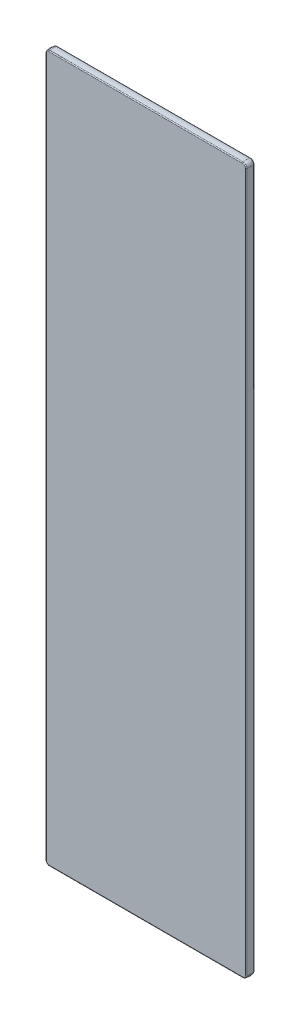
ISO-10303-21;
HEADER;
FILE_DESCRIPTION(('STEP AP214'),'2;1');
FILE_NAME('part.step','',(''),(''),'','','');
FILE_SCHEMA(('AUTOMOTIVE_DESIGN { 1 0 10303 214 1 1 1 1 }'));
ENDSEC;
DATA;
#1=APPLICATION_CONTEXT('core data for automotive mechanical design processes');
#2=APPLICATION_PROTOCOL_DEFINITION('international standard','automotive_design',2000,#1);
#3=PRODUCT_CONTEXT('',#1,'mechanical');
#4=PRODUCT('Part','Part','',(#3));
#5=PRODUCT_RELATED_PRODUCT_CATEGORY('part','',(#4));
#6=PRODUCT_DEFINITION_FORMATION('','',#4);
#7=PRODUCT_DEFINITION_CONTEXT('part definition',#1,'design');
#8=PRODUCT_DEFINITION('design','',#6,#7);
#9=PRODUCT_DEFINITION_SHAPE('','',#8);
#10=(LENGTH_UNIT() NAMED_UNIT(*) SI_UNIT(.MILLI.,.METRE.));
#11=(NAMED_UNIT(*) PLANE_ANGLE_UNIT() SI_UNIT($,.RADIAN.));
#12=(NAMED_UNIT(*) SI_UNIT($,.STERADIAN.) SOLID_ANGLE_UNIT());
#13=UNCERTAINTY_MEASURE_WITH_UNIT(LENGTH_MEASURE(1.E-05),#10,'distance_accuracy_value','');
#14=(GEOMETRIC_REPRESENTATION_CONTEXT(3) GLOBAL_UNCERTAINTY_ASSIGNED_CONTEXT((#13)) GLOBAL_UNIT_ASSIGNED_CONTEXT((#10,
#11,#12)) REPRESENTATION_CONTEXT('',''));
#15=CARTESIAN_POINT('',(0.,0.,0.));
#16=DIRECTION('',(0.,0.,1.));
#17=DIRECTION('',(1.,0.,0.));
#18=AXIS2_PLACEMENT_3D('',#15,#16,#17);
#19=CARTESIAN_POINT('',(247.499471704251,-322.171583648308,261.128082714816));
#20=DIRECTION('',(3.16923956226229E-08,-3.73783141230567E-09,-1.));
#21=DIRECTION('',(-0.999999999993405,3.63158778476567E-06,-3.16924091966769E-08));
#22=AXIS2_PLACEMENT_3D('',#19,#20,#21);
#23=PLANE('',#22);
#24=CARTESIAN_POINT('',(200.000100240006,-149.096855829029,261.128080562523));
#25=CARTESIAN_POINT('',(199.749756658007,-149.096854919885,261.128080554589));
#26=CARTESIAN_POINT('',(199.500266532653,-149.15574160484,261.128080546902));
#27=CARTESIAN_POINT('',(199.269562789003,-149.27349976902,261.128080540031));
#28=CARTESIAN_POINT('',(198.94562818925,-149.552758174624,261.128080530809));
#29=CARTESIAN_POINT('',(198.753983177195,-149.927429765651,261.128080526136));
#30=CARTESIAN_POINT('',(198.701652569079,-150.088383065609,261.128080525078));
#31=CARTESIAN_POINT('',(198.675540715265,-150.254705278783,261.128080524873));
#32=CARTESIAN_POINT('',(198.675540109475,-150.421406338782,261.128080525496));
#33=B_SPLINE_CURVE_WITH_KNOTS('',5,(#24,#25,#26,#27,#28,#29,#30,#31,#32),.UNSPECIFIED.,.F.,.F.,
(6,3,6),(0.,0.600280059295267,1.),.UNSPECIFIED.);
#34=CARTESIAN_POINT('',(200.000100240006,-149.096855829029,261.128080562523));
#35=VERTEX_POINT('',#34);
#36=CARTESIAN_POINT('',(198.675540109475,-150.421406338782,261.128080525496));
#37=VERTEX_POINT('',#36);
#38=EDGE_CURVE('E241',#35,#37,#33,.T.);
#39=ORIENTED_EDGE('',*,*,#38,.F.);
#40=DIRECTION('',(-0.999999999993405,3.63158778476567E-06,-3.16924091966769E-08));
#41=VECTOR('',#40,1.);
#42=CARTESIAN_POINT('',(247.500100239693,-149.097028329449,261.128082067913));
#43=LINE('',#42,#41);
#44=CARTESIAN_POINT('',(295.000100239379,-149.097200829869,261.128083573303));
#45=VERTEX_POINT('',#44);
#46=EDGE_CURVE('E37',#45,#35,#43,.T.);
#47=ORIENTED_EDGE('',*,*,#46,.F.);
#48=CARTESIAN_POINT('',(296.324650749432,-150.421760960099,261.128083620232));
#49=CARTESIAN_POINT('',(296.324651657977,-150.1714173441,261.128083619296));
#50=CARTESIAN_POINT('',(296.265764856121,-149.921927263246,261.128083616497));
#51=CARTESIAN_POINT('',(296.148006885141,-149.691223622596,261.128083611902));
#52=CARTESIAN_POINT('',(295.868748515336,-149.367288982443,261.128083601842));
#53=CARTESIAN_POINT('',(295.49407684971,-149.175643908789,261.128083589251));
#54=CARTESIAN_POINT('',(295.333123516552,-149.123313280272,261.128083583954));
#55=CARTESIAN_POINT('',(295.166801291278,-149.097201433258,261.128083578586));
#56=CARTESIAN_POINT('',(295.000100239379,-149.097200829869,261.128083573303));
#57=B_SPLINE_CURVE_WITH_KNOTS('',5,(#48,#49,#50,#51,#52,#53,#54,#55,#56),.UNSPECIFIED.,.F.,.F.,
(6,3,6),(0.,0.600280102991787,1.),.UNSPECIFIED.);
#58=CARTESIAN_POINT('',(296.324650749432,-150.421760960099,261.128083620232));
#59=VERTEX_POINT('',#58);
#60=EDGE_CURVE('E176',#59,#45,#57,.T.);
#61=ORIENTED_EDGE('',*,*,#60,.F.);
#62=DIRECTION('',(3.63158778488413E-06,0.999999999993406,-3.73771631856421E-09));
#63=VECTOR('',#62,1.);
#64=CARTESIAN_POINT('',(296.32402702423,-322.171760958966,261.128084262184));
#65=LINE('',#64,#63);
#66=CARTESIAN_POINT('',(296.323403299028,-493.921760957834,261.128084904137));
#67=VERTEX_POINT('',#66);
#68=EDGE_CURVE('E211',#67,#59,#65,.T.);
#69=ORIENTED_EDGE('',*,*,#68,.F.);
#70=CARTESIAN_POINT('',(294.998843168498,-495.246311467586,261.128084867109));
#71=CARTESIAN_POINT('',(295.249186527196,-495.24631237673,261.128084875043));
#72=CARTESIAN_POINT('',(295.498676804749,-495.187425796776,261.12808488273));
#73=CARTESIAN_POINT('',(295.729380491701,-495.069667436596,261.128084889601));
#74=CARTESIAN_POINT('',(296.053314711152,-494.790409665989,261.128084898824));
#75=CARTESIAN_POINT('',(296.244960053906,-494.415738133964,261.128084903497));
#76=CARTESIAN_POINT('',(296.297290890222,-494.254784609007,261.128084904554));
#77=CARTESIAN_POINT('',(296.323402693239,-494.088461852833,261.12808490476));
#78=CARTESIAN_POINT('',(296.323403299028,-493.921760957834,261.128084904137));
#79=B_SPLINE_CURVE_WITH_KNOTS('',5,(#70,#71,#72,#73,#74,#75,#76,#77,#78),.UNSPECIFIED.,.F.,.F.,
(6,3,6),(0.,0.600280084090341,1.),.UNSPECIFIED.);
#80=CARTESIAN_POINT('',(294.998843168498,-495.246311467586,261.128084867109));
#81=VERTEX_POINT('',#80);
#82=EDGE_CURVE('E175',#81,#67,#79,.T.);
#83=ORIENTED_EDGE('',*,*,#82,.F.);
#84=DIRECTION('',(0.999999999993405,-3.63158778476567E-06,3.16924091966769E-08));
#85=VECTOR('',#84,1.);
#86=CARTESIAN_POINT('',(247.49884316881,-495.246138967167,261.12808336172));
#87=LINE('',#86,#85);
#88=CARTESIAN_POINT('',(199.998843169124,-495.245966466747,261.128081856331));
#89=VERTEX_POINT('',#88);
#90=EDGE_CURVE('E215',#89,#81,#87,.T.);
#91=ORIENTED_EDGE('',*,*,#90,.F.);
#92=CARTESIAN_POINT('',(198.674292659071,-493.921406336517,261.128081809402));
#93=CARTESIAN_POINT('',(198.674291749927,-494.171749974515,261.128081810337));
#94=CARTESIAN_POINT('',(198.733178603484,-494.421239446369,261.128081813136));
#95=CARTESIAN_POINT('',(198.850936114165,-494.651942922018,261.128081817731));
#96=CARTESIAN_POINT('',(199.13019396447,-494.975877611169,261.128081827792));
#97=CARTESIAN_POINT('',(199.504865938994,-495.167523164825,261.128081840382));
#98=CARTESIAN_POINT('',(199.665819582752,-495.219854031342,261.128081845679));
#99=CARTESIAN_POINT('',(199.832142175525,-495.245965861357,261.128081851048));
#100=CARTESIAN_POINT('',(199.998843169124,-495.245966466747,261.128081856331));
#101=B_SPLINE_CURVE_WITH_KNOTS('',5,(#92,#93,#94,#95,#96,#97,#98,#99,#100),.UNSPECIFIED.,.F.,
.F.,(6,3,6),(0.,0.600280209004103,1.),.UNSPECIFIED.);
#102=CARTESIAN_POINT('',(198.674292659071,-493.921406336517,261.128081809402));
#103=VERTEX_POINT('',#102);
#104=EDGE_CURVE('E233',#103,#89,#101,.T.);
#105=ORIENTED_EDGE('',*,*,#104,.F.);
#106=DIRECTION('',(-3.63158778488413E-06,-0.999999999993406,3.73771631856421E-09));
#107=VECTOR('',#106,1.);
#108=CARTESIAN_POINT('',(198.674915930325,-322.296406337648,261.128081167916));
#109=LINE('',#108,#107);
#110=CARTESIAN_POINT('',(198.675539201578,-150.67140633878,261.12808052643));
#111=VERTEX_POINT('',#110);
#112=EDGE_CURVE('E219',#111,#103,#109,.T.);
#113=ORIENTED_EDGE('',*,*,#112,.F.);
#114=DIRECTION('',(-3.63158778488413E-06,-0.999999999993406,3.73771631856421E-09));
#115=VECTOR('',#114,1.);
#116=CARTESIAN_POINT('',(198.675539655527,-150.546406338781,261.128080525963));
#117=LINE('',#116,#115);
#118=EDGE_CURVE('E223',#37,#111,#117,.T.);
#119=ORIENTED_EDGE('',*,*,#118,.F.);
#120=EDGE_LOOP('',(#39,#47,#61,#69,#83,#91,#105,#113,#119));
#121=FACE_BOUND('',#120,.T.);
#122=ADVANCED_FACE('F17',(#121),#23,.T.);
#123=CARTESIAN_POINT('',(247.499471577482,-322.171583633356,265.128082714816));
#124=DIRECTION('',(3.16923956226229E-08,-3.73783141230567E-09,-1.));
#125=DIRECTION('',(-0.999999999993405,3.63158778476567E-06,-3.16924091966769E-08));
#126=AXIS2_PLACEMENT_3D('',#123,#124,#125);
#127=PLANE('',#126);
#128=DIRECTION('',(-3.63158778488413E-06,-0.999999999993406,3.73771631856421E-09));
#129=VECTOR('',#128,1.);
#130=CARTESIAN_POINT('',(198.675539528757,-150.546406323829,265.128080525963));
#131=LINE('',#130,#129);
#132=CARTESIAN_POINT('',(198.675539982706,-150.42140632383,265.128080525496));
#133=VERTEX_POINT('',#132);
#134=CARTESIAN_POINT('',(198.675539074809,-150.671406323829,265.12808052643));
#135=VERTEX_POINT('',#134);
#136=EDGE_CURVE('E11',#133,#135,#131,.T.);
#137=ORIENTED_EDGE('',*,*,#136,.T.);
#138=DIRECTION('',(-3.63158778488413E-06,-0.999999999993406,3.73771631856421E-09));
#139=VECTOR('',#138,1.);
#140=CARTESIAN_POINT('',(198.674915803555,-322.296406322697,265.128081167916));
#141=LINE('',#140,#139);
#142=CARTESIAN_POINT('',(198.674292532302,-493.921406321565,265.128081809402));
#143=VERTEX_POINT('',#142);
#144=EDGE_CURVE('E28',#135,#143,#141,.T.);
#145=ORIENTED_EDGE('',*,*,#144,.T.);
#146=CARTESIAN_POINT('',(198.674292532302,-493.921406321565,265.128081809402));
#147=CARTESIAN_POINT('',(198.674291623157,-494.171749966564,265.128081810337));
#148=CARTESIAN_POINT('',(198.733178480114,-494.421239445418,265.128081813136));
#149=CARTESIAN_POINT('',(198.850935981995,-494.651942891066,265.128081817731));
#150=CARTESIAN_POINT('',(199.1301938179,-494.975877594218,265.128081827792));
#151=CARTESIAN_POINT('',(199.504865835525,-495.167523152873,265.128081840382));
#152=CARTESIAN_POINT('',(199.665819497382,-495.219854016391,265.128081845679));
#153=CARTESIAN_POINT('',(199.832142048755,-495.245965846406,265.128081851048));
#154=CARTESIAN_POINT('',(199.998843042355,-495.245966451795,265.128081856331));
#155=B_SPLINE_CURVE_WITH_KNOTS('',5,(#146,#147,#148,#149,#150,#151,#152,#153,#154),
.UNSPECIFIED.,.F.,.F.,(6,3,6),(0.,0.600280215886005,1.),.UNSPECIFIED.);
#156=CARTESIAN_POINT('',(199.998843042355,-495.245966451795,265.128081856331));
#157=VERTEX_POINT('',#156);
#158=EDGE_CURVE('E362',#143,#157,#155,.T.);
#159=ORIENTED_EDGE('',*,*,#158,.T.);
#160=DIRECTION('',(0.999999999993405,-3.63158778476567E-06,3.16924091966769E-08));
#161=VECTOR('',#160,1.);
#162=CARTESIAN_POINT('',(247.498843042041,-495.246138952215,265.12808336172));
#163=LINE('',#162,#161);
#164=CARTESIAN_POINT('',(294.998843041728,-495.246311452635,265.128084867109));
#165=VERTEX_POINT('',#164);
#166=EDGE_CURVE('E355',#157,#165,#163,.T.);
#167=ORIENTED_EDGE('',*,*,#166,.T.);
#168=CARTESIAN_POINT('',(294.998843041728,-495.246311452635,265.128084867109));
#169=CARTESIAN_POINT('',(295.249186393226,-495.246312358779,265.128084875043));
#170=CARTESIAN_POINT('',(295.49867666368,-495.187425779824,265.12808488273));
#171=CARTESIAN_POINT('',(295.729380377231,-495.069667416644,265.128084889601));
#172=CARTESIAN_POINT('',(296.053314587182,-494.790409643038,265.128084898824));
#173=CARTESIAN_POINT('',(296.244959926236,-494.415738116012,265.128084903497));
#174=CARTESIAN_POINT('',(296.297290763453,-494.254784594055,265.128084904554));
#175=CARTESIAN_POINT('',(296.323402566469,-494.088461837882,265.12808490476));
#176=CARTESIAN_POINT('',(296.323403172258,-493.921760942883,265.128084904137));
#177=B_SPLINE_CURVE_WITH_KNOTS('',5,(#168,#169,#170,#171,#172,#173,#174,#175,#176),
.UNSPECIFIED.,.F.,.F.,(6,3,6),(0.,0.600280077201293,1.),.UNSPECIFIED.);
#178=CARTESIAN_POINT('',(296.323403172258,-493.921760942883,265.128084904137));
#179=VERTEX_POINT('',#178);
#180=EDGE_CURVE('E350',#165,#179,#177,.T.);
#181=ORIENTED_EDGE('',*,*,#180,.T.);
#182=DIRECTION('',(3.6315877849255E-06,0.999999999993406,-3.73771631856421E-09));
#183=VECTOR('',#182,1.);
#184=CARTESIAN_POINT('',(296.32402689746,-322.171760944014,265.128084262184));
#185=LINE('',#184,#183);
#186=CARTESIAN_POINT('',(296.324650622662,-150.421760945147,265.128083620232));
#187=VERTEX_POINT('',#186);
#188=EDGE_CURVE('E343',#179,#187,#185,.T.);
#189=ORIENTED_EDGE('',*,*,#188,.T.);
#190=CARTESIAN_POINT('',(296.324650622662,-150.421760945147,265.128083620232));
#191=CARTESIAN_POINT('',(296.324651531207,-150.171417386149,265.128083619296));
#192=CARTESIAN_POINT('',(296.265764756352,-149.921926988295,265.128083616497));
#193=CARTESIAN_POINT('',(296.148006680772,-149.691223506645,265.128083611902));
#194=CARTESIAN_POINT('',(295.868748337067,-149.367288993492,265.128083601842));
#195=CARTESIAN_POINT('',(295.494076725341,-149.175643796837,265.128083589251));
#196=CARTESIAN_POINT('',(295.333123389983,-149.123313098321,265.128083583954));
#197=CARTESIAN_POINT('',(295.166801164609,-149.097201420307,265.128083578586));
#198=CARTESIAN_POINT('',(295.000100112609,-149.097200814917,265.128083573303));
#199=B_SPLINE_CURVE_WITH_KNOTS('',5,(#190,#191,#192,#193,#194,#195,#196,#197,#198),
.UNSPECIFIED.,.F.,.F.,(6,3,6),(0.,0.600280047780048,1.),.UNSPECIFIED.);
#200=CARTESIAN_POINT('',(295.000100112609,-149.097200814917,265.128083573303));
#201=VERTEX_POINT('',#200);
#202=EDGE_CURVE('E338',#187,#201,#199,.T.);
#203=ORIENTED_EDGE('',*,*,#202,.T.);
#204=DIRECTION('',(-0.999999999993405,3.63158778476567E-06,-3.16924091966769E-08));
#205=VECTOR('',#204,1.);
#206=CARTESIAN_POINT('',(247.500100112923,-149.097028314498,265.128082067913));
#207=LINE('',#206,#205);
#208=CARTESIAN_POINT('',(200.000100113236,-149.096855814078,265.128080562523));
#209=VERTEX_POINT('',#208);
#210=EDGE_CURVE('E331',#201,#209,#207,.T.);
#211=ORIENTED_EDGE('',*,*,#210,.T.);
#212=CARTESIAN_POINT('',(200.000100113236,-149.096855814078,265.128080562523));
#213=CARTESIAN_POINT('',(199.749756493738,-149.096854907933,265.128080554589));
#214=CARTESIAN_POINT('',(199.500266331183,-149.155741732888,265.128080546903));
#215=CARTESIAN_POINT('',(199.269562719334,-149.273499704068,265.128080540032));
#216=CARTESIAN_POINT('',(198.94562808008,-149.552758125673,265.128080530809));
#217=CARTESIAN_POINT('',(198.753983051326,-149.9274297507,265.128080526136));
#218=CARTESIAN_POINT('',(198.701652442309,-150.088383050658,265.128080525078));
#219=CARTESIAN_POINT('',(198.675540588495,-150.254705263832,265.128080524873));
#220=CARTESIAN_POINT('',(198.675539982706,-150.42140632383,265.128080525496));
#221=B_SPLINE_CURVE_WITH_KNOTS('',5,(#212,#213,#214,#215,#216,#217,#218,#219,#220),
.UNSPECIFIED.,.F.,.F.,(6,3,6),(0.,0.600280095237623,1.),.UNSPECIFIED.);
#222=EDGE_CURVE('E279',#209,#133,#221,.T.);
#223=ORIENTED_EDGE('',*,*,#222,.T.);
#224=EDGE_LOOP('',(#137,#145,#159,#167,#181,#189,#203,#211,#223));
#225=FACE_BOUND('',#224,.T.);
#226=ADVANCED_FACE('F439',(#225),#127,.F.);
#227=CARTESIAN_POINT('',(198.675539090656,-150.671406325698,264.628080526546));
#228=DIRECTION('',(3.63158785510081E-06,0.999999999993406,-3.73780513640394E-09));
#229=DIRECTION('',(-3.16923956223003E-08,3.73792023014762E-09,1.));
#230=AXIS2_PLACEMENT_3D('',#227,#228,#229);
#231=CYLINDRICAL_SURFACE('',#230,0.499999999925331);
#232=CARTESIAN_POINT('',(198.675539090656,-150.671406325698,264.628080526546));
#233=DIRECTION('',(3.63158785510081E-06,0.999999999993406,-3.73780513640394E-09));
#234=DIRECTION('',(-3.16923956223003E-08,3.73792023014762E-09,1.));
#235=AXIS2_PLACEMENT_3D('',#232,#233,#234);
#236=CIRCLE('',#235,0.499999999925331);
#237=CARTESIAN_POINT('',(198.189034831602,-150.671404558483,264.743465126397));
#238=VERTEX_POINT('',#237);
#239=EDGE_CURVE('E277',#238,#135,#236,.T.);
#240=ORIENTED_EDGE('',*,*,#239,.T.);
#241=ORIENTED_EDGE('',*,*,#136,.F.);
#242=CARTESIAN_POINT('',(198.675539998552,-150.421406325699,264.628080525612));
#243=DIRECTION('',(3.63158778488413E-06,0.999999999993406,-3.73771631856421E-09));
#244=DIRECTION('',(-3.16923956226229E-08,3.73783141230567E-09,1.));
#245=AXIS2_PLACEMENT_3D('',#242,#243,#244);
#246=CIRCLE('',#245,0.499999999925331);
#247=CARTESIAN_POINT('',(198.189035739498,-150.421404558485,264.743465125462));
#248=VERTEX_POINT('',#247);
#249=EDGE_CURVE('E265',#248,#133,#246,.T.);
#250=ORIENTED_EDGE('',*,*,#249,.F.);
#251=DIRECTION('',(-3.63158778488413E-06,-0.999999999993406,3.73771631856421E-09));
#252=VECTOR('',#251,1.);
#253=CARTESIAN_POINT('',(198.18903528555,-150.546404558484,264.74346512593));
#254=LINE('',#253,#252);
#255=EDGE_CURVE('E274',#248,#238,#254,.T.);
#256=ORIENTED_EDGE('',*,*,#255,.T.);
#257=EDGE_LOOP('',(#240,#241,#250,#256));
#258=FACE_BOUND('',#257,.T.);
#259=ADVANCED_FACE('F435',(#258),#231,.T.);
#260=CARTESIAN_POINT('',(198.674292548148,-493.921406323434,264.628081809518));
#261=DIRECTION('',(3.63158778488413E-06,0.999999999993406,-3.73771631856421E-09));
#262=DIRECTION('',(-3.16923956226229E-08,3.73783141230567E-09,1.));
#263=AXIS2_PLACEMENT_3D('',#260,#261,#262);
#264=CYLINDRICAL_SURFACE('',#263,0.499999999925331);
#265=CARTESIAN_POINT('',(198.674292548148,-493.921406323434,264.628081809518));
#266=DIRECTION('',(3.63158778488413E-06,0.999999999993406,-3.73771631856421E-09));
#267=DIRECTION('',(-3.16923956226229E-08,3.73783141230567E-09,1.));
#268=AXIS2_PLACEMENT_3D('',#265,#266,#267);
#269=CIRCLE('',#268,0.499999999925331);
#270=CARTESIAN_POINT('',(198.187788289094,-493.92140455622,264.743466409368));
#271=VERTEX_POINT('',#270);
#272=EDGE_CURVE('E271',#271,#143,#269,.T.);
#273=ORIENTED_EDGE('',*,*,#272,.T.);
#274=ORIENTED_EDGE('',*,*,#144,.F.);
#275=ORIENTED_EDGE('',*,*,#239,.F.);
#276=DIRECTION('',(-3.63158778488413E-06,-0.999999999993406,3.73771631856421E-09));
#277=VECTOR('',#276,1.);
#278=CARTESIAN_POINT('',(198.188411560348,-322.296404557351,264.743465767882));
#279=LINE('',#278,#277);
#280=EDGE_CURVE('E268',#238,#271,#279,.T.);
#281=ORIENTED_EDGE('',*,*,#280,.T.);
#282=EDGE_LOOP('',(#273,#274,#275,#281));
#283=FACE_BOUND('',#282,.T.);
#284=ADVANCED_FACE('F437',(#283),#264,.T.);
#285=CARTESIAN_POINT('',(198.675539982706,-150.42140632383,265.128080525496));
#286=CARTESIAN_POINT('',(198.280255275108,-150.421404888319,265.128080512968));
#287=CARTESIAN_POINT('',(198.189035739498,-150.421404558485,264.743465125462));
#288=CARTESIAN_POINT('',(198.675540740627,-150.212841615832,265.128080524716));
#289=CARTESIAN_POINT('',(198.280256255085,-150.150868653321,265.128080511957));
#290=CARTESIAN_POINT('',(198.18903677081,-150.136567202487,264.743465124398));
#291=CARTESIAN_POINT('',(198.716414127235,-150.004886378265,265.128080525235));
#292=CARTESIAN_POINT('',(198.333274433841,-149.880585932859,265.128080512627));
#293=CARTESIAN_POINT('',(198.244857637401,-149.851900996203,264.743465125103));
#294=CARTESIAN_POINT('',(198.798085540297,-149.807985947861,265.128080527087));
#295=CARTESIAN_POINT('',(198.439503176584,-149.624735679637,265.128080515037));
#296=CARTESIAN_POINT('',(198.356753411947,-149.582447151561,264.743465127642));
#297=CARTESIAN_POINT('',(199.034697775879,-149.455996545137,265.12808053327));
#298=CARTESIAN_POINT('',(198.74659928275,-149.16789295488,265.128080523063));
#299=CARTESIAN_POINT('',(198.680115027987,-149.101407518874,264.743465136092));
#300=CARTESIAN_POINT('',(199.386675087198,-149.219401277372,265.12808054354));
#301=CARTESIAN_POINT('',(199.20342629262,-148.860818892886,265.128080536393));
#302=CARTESIAN_POINT('',(199.161138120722,-148.778069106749,264.743465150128));
#303=CARTESIAN_POINT('',(199.583571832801,-149.137728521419,265.128080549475));
#304=CARTESIAN_POINT('',(199.459271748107,-148.75458830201,265.128080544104));
#305=CARTESIAN_POINT('',(199.43058703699,-148.666171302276,264.74346515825));
#306=CARTESIAN_POINT('',(199.791531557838,-149.096855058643,265.128080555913));
#307=CARTESIAN_POINT('',(199.729560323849,-148.701570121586,265.128080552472));
#308=CARTESIAN_POINT('',(199.715259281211,-148.610350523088,264.743465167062));
#309=CARTESIAN_POINT('',(200.000100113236,-149.096855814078,265.128080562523));
#310=CARTESIAN_POINT('',(200.000101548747,-148.70157110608,265.128080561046));
#311=CARTESIAN_POINT('',(200.000101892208,-148.610351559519,264.74346517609));
#312=(BOUNDED_SURFACE() B_SPLINE_SURFACE(5,2,((#285,#286,#287),(#288,#289,#290),(#291,#292,
#293),(#294,#295,#296),(#297,#298,#299),(#300,#301,#302),(#303,#304,#305),(#306,#307,#308),
(#309,#310,#311)),.UNSPECIFIED.,.F.,.F.,.F.) B_SPLINE_SURFACE_WITH_KNOTS((6,3,6),(3,3),(0.,
0.499995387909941,1.),(0.,1.),
.UNSPECIFIED.) GEOMETRIC_REPRESENTATION_ITEM() RATIONAL_B_SPLINE_SURFACE(((1.,0.784464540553,
1.),(1.,0.784464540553,1.),(1.,0.784464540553,1.),(1.,0.784464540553,1.),(1.,0.784464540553,1.),
(1.,0.784464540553,1.),(1.,0.784464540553,1.),(1.,0.784464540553,1.),(1.,0.784464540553,1.))) REPRESENTATION_ITEM('') SURFACE());
#313=CARTESIAN_POINT('',(200.000100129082,-149.096855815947,264.628080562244));
#314=DIRECTION('',(0.999999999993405,-3.63158778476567E-06,3.16924091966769E-08));
#315=DIRECTION('',(-3.16923956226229E-08,3.73783141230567E-09,1.));
#316=AXIS2_PLACEMENT_3D('',#313,#314,#315);
#317=CIRCLE('',#316,0.500000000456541);
#318=CARTESIAN_POINT('',(200.000101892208,-148.610351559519,264.74346517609));
#319=VERTEX_POINT('',#318);
#320=EDGE_CURVE('E257',#319,#209,#317,.T.);
#321=CARTESIAN_POINT('',(200.000101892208,-148.610351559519,264.74346517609));
#322=CARTESIAN_POINT('',(199.715259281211,-148.610350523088,264.743465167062));
#323=CARTESIAN_POINT('',(199.43058703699,-148.666171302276,264.74346515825));
#324=CARTESIAN_POINT('',(199.161138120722,-148.778069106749,264.743465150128));
#325=CARTESIAN_POINT('',(198.680115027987,-149.101407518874,264.743465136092));
#326=CARTESIAN_POINT('',(198.356753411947,-149.582447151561,264.743465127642));
#327=CARTESIAN_POINT('',(198.244857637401,-149.851900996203,264.743465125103));
#328=CARTESIAN_POINT('',(198.18903677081,-150.136567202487,264.743465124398));
#329=CARTESIAN_POINT('',(198.189035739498,-150.421404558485,264.743465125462));
#330=B_SPLINE_CURVE_WITH_KNOTS('',5,(#321,#322,#323,#324,#325,#326,#327,#328,#329),
.UNSPECIFIED.,.F.,.F.,(6,3,6),(0.,0.500004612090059,1.),.UNSPECIFIED.);
#331=EDGE_CURVE('E264',#319,#248,#330,.T.);
#332=ORIENTED_EDGE('',*,*,#249,.T.);
#333=ORIENTED_EDGE('',*,*,#222,.F.);
#334=ORIENTED_EDGE('',*,*,#320,.F.);
#335=ORIENTED_EDGE('',*,*,#331,.T.);
#336=EDGE_LOOP('',(#332,#333,#334,#335));
#337=FACE_BOUND('',#336,.T.);
#338=ADVANCED_FACE('F441',(#337),#312,.T.);
#339=CARTESIAN_POINT('',(199.998843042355,-495.245966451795,265.128081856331));
#340=CARTESIAN_POINT('',(199.998841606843,-495.641251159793,265.128081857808));
#341=CARTESIAN_POINT('',(199.998841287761,-495.73247070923,264.743466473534));
#342=CARTESIAN_POINT('',(199.790278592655,-495.245965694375,265.128081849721));
#343=CARTESIAN_POINT('',(199.728305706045,-495.641250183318,265.128081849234));
#344=CARTESIAN_POINT('',(199.714004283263,-495.732469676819,264.743466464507));
#345=CARTESIAN_POINT('',(199.582322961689,-495.205092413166,265.128081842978));
#346=CARTESIAN_POINT('',(199.458022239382,-495.58823229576,265.12808184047));
#347=CARTESIAN_POINT('',(199.429337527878,-495.676649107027,264.743466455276));
#348=CARTESIAN_POINT('',(199.385422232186,-495.123420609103,265.128081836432));
#349=CARTESIAN_POINT('',(199.202171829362,-495.482002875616,265.128081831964));
#350=CARTESIAN_POINT('',(199.159883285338,-495.564752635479,264.743466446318));
#351=CARTESIAN_POINT('',(199.033433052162,-494.886808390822,265.128081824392));
#352=CARTESIAN_POINT('',(198.745329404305,-495.17490681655,265.128081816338));
#353=CARTESIAN_POINT('',(198.678843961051,-495.24139106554,264.743466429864));
#354=CARTESIAN_POINT('',(198.796837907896,-494.534831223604,265.128081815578));
#355=CARTESIAN_POINT('',(198.43825549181,-494.718079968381,265.128081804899));
#356=CARTESIAN_POINT('',(198.355505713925,-494.760368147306,264.743466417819));
#357=CARTESIAN_POINT('',(198.715165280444,-494.337934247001,265.128081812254));
#358=CARTESIAN_POINT('',(198.332025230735,-494.462234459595,265.128081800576));
#359=CARTESIAN_POINT('',(198.243608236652,-494.490919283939,264.743466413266));
#360=CARTESIAN_POINT('',(198.674291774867,-494.129974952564,265.128081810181));
#361=CARTESIAN_POINT('',(198.27900683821,-494.191946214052,265.128081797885));
#362=CARTESIAN_POINT('',(198.187787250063,-494.206247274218,264.743466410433));
#363=CARTESIAN_POINT('',(198.674292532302,-493.921406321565,265.128081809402));
#364=CARTESIAN_POINT('',(198.279007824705,-493.921404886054,265.128081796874));
#365=CARTESIAN_POINT('',(198.187788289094,-493.92140455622,264.743466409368));
#366=(BOUNDED_SURFACE() B_SPLINE_SURFACE(5,2,((#339,#340,#341),(#342,#343,#344),(#345,#346,
#347),(#348,#349,#350),(#351,#352,#353),(#354,#355,#356),(#357,#358,#359),(#360,#361,#362),
(#363,#364,#365)),.UNSPECIFIED.,.F.,.F.,.F.) B_SPLINE_SURFACE_WITH_KNOTS((6,3,6),(3,3),(0.,
0.49999498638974,1.),(0.,1.),
.UNSPECIFIED.) GEOMETRIC_REPRESENTATION_ITEM() RATIONAL_B_SPLINE_SURFACE(((1.,0.784464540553,
1.),(1.,0.784464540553,1.),(1.,0.784464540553,1.),(1.,0.784464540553,1.),(1.,0.784464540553,1.),
(1.,0.784464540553,1.),(1.,0.784464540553,1.),(1.,0.784464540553,1.),(1.,0.784464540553,1.))) REPRESENTATION_ITEM('') SURFACE());
#367=CARTESIAN_POINT('',(199.998843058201,-495.245966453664,264.628081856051));
#368=DIRECTION('',(-0.999999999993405,3.63158778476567E-06,-3.16924091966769E-08));
#369=DIRECTION('',(3.16923956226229E-08,-3.73783141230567E-09,-1.));
#370=AXIS2_PLACEMENT_3D('',#367,#368,#369);
#371=CIRCLE('',#370,0.500000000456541);
#372=CARTESIAN_POINT('',(199.998841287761,-495.73247070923,264.743466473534));
#373=VERTEX_POINT('',#372);
#374=EDGE_CURVE('E261',#373,#157,#371,.T.);
#375=CARTESIAN_POINT('',(198.187788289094,-493.92140455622,264.743466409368));
#376=CARTESIAN_POINT('',(198.187787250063,-494.206247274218,264.743466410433));
#377=CARTESIAN_POINT('',(198.243608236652,-494.490919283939,264.743466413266));
#378=CARTESIAN_POINT('',(198.355505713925,-494.760368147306,264.743466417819));
#379=CARTESIAN_POINT('',(198.678843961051,-495.24139106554,264.743466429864));
#380=CARTESIAN_POINT('',(199.159883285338,-495.564752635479,264.743466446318));
#381=CARTESIAN_POINT('',(199.429337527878,-495.676649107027,264.743466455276));
#382=CARTESIAN_POINT('',(199.714004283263,-495.732469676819,264.743466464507));
#383=CARTESIAN_POINT('',(199.998841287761,-495.73247070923,264.743466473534));
#384=B_SPLINE_CURVE_WITH_KNOTS('',5,(#375,#376,#377,#378,#379,#380,#381,#382,#383),
.UNSPECIFIED.,.F.,.F.,(6,3,6),(0.,0.50000501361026,1.),.UNSPECIFIED.);
#385=EDGE_CURVE('E260',#271,#373,#384,.T.);
#386=ORIENTED_EDGE('',*,*,#374,.T.);
#387=ORIENTED_EDGE('',*,*,#158,.F.);
#388=ORIENTED_EDGE('',*,*,#272,.F.);
#389=ORIENTED_EDGE('',*,*,#385,.T.);
#390=EDGE_LOOP('',(#386,#387,#388,#389));
#391=FACE_BOUND('',#390,.T.);
#392=ADVANCED_FACE('F478',(#391),#366,.T.);
#393=CARTESIAN_POINT('',(200.000100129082,-149.096855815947,264.628080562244));
#394=DIRECTION('',(0.999999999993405,-3.63158778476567E-06,3.16924091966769E-08));
#395=DIRECTION('',(-3.16923956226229E-08,3.73783141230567E-09,1.));
#396=AXIS2_PLACEMENT_3D('',#393,#394,#395);
#397=CYLINDRICAL_SURFACE('',#396,0.500000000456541);
#398=ORIENTED_EDGE('',*,*,#320,.T.);
#399=ORIENTED_EDGE('',*,*,#210,.F.);
#400=CARTESIAN_POINT('',(295.000100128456,-149.097200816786,264.628083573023));
#401=DIRECTION('',(0.999999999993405,-3.63158778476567E-06,3.16924091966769E-08));
#402=DIRECTION('',(-3.16923956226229E-08,3.73783141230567E-09,1.));
#403=AXIS2_PLACEMENT_3D('',#400,#401,#402);
#404=CIRCLE('',#403,0.500000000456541);
#405=CARTESIAN_POINT('',(295.000101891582,-148.610696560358,264.743468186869));
#406=VERTEX_POINT('',#405);
#407=EDGE_CURVE('E246',#406,#201,#404,.T.);
#408=ORIENTED_EDGE('',*,*,#407,.F.);
#409=DIRECTION('',(-0.999999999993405,3.63158778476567E-06,-3.16924091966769E-08));
#410=VECTOR('',#409,1.);
#411=CARTESIAN_POINT('',(247.500101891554,-148.610524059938,264.743466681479));
#412=LINE('',#411,#410);
#413=EDGE_CURVE('E255',#406,#319,#412,.T.);
#414=ORIENTED_EDGE('',*,*,#413,.T.);
#415=EDGE_LOOP('',(#398,#399,#408,#414));
#416=FACE_BOUND('',#415,.T.);
#417=ADVANCED_FACE('F488',(#416),#397,.T.);
#418=CARTESIAN_POINT('',(294.998843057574,-495.246311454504,264.62808486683));
#419=DIRECTION('',(-0.999999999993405,3.63158778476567E-06,-3.16924091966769E-08));
#420=DIRECTION('',(3.16923956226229E-08,-3.73783141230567E-09,-1.));
#421=AXIS2_PLACEMENT_3D('',#418,#419,#420);
#422=CYLINDRICAL_SURFACE('',#421,0.500000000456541);
#423=CARTESIAN_POINT('',(294.998843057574,-495.246311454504,264.62808486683));
#424=DIRECTION('',(-0.999999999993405,3.63158778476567E-06,-3.16924091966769E-08));
#425=DIRECTION('',(3.16923956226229E-08,-3.73783141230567E-09,-1.));
#426=AXIS2_PLACEMENT_3D('',#423,#424,#425);
#427=CIRCLE('',#426,0.500000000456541);
#428=CARTESIAN_POINT('',(294.998841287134,-495.732815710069,264.743469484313));
#429=VERTEX_POINT('',#428);
#430=EDGE_CURVE('E252',#429,#165,#427,.T.);
#431=ORIENTED_EDGE('',*,*,#430,.T.);
#432=ORIENTED_EDGE('',*,*,#166,.F.);
#433=ORIENTED_EDGE('',*,*,#374,.F.);
#434=DIRECTION('',(0.999999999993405,-3.63158778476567E-06,3.16924091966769E-08));
#435=VECTOR('',#434,1.);
#436=CARTESIAN_POINT('',(247.498841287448,-495.73264320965,264.743467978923));
#437=LINE('',#436,#435);
#438=EDGE_CURVE('E249',#373,#429,#437,.T.);
#439=ORIENTED_EDGE('',*,*,#438,.T.);
#440=EDGE_LOOP('',(#431,#432,#433,#439));
#441=FACE_BOUND('',#440,.T.);
#442=ADVANCED_FACE('F500',(#441),#422,.T.);
#443=CARTESIAN_POINT('',(295.000100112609,-149.097200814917,265.128083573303));
#444=CARTESIAN_POINT('',(295.000101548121,-148.70191610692,265.128083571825));
#445=CARTESIAN_POINT('',(295.000101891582,-148.610696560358,264.743468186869));
#446=CARTESIAN_POINT('',(295.208664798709,-149.097201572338,265.128083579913));
#447=CARTESIAN_POINT('',(295.270637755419,-148.701917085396,265.128083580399));
#448=CARTESIAN_POINT('',(295.28493921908,-148.61069758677,264.743468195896));
#449=CARTESIAN_POINT('',(295.416620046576,-149.138074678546,265.128083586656));
#450=CARTESIAN_POINT('',(295.540920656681,-148.754935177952,265.128083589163));
#451=CARTESIAN_POINT('',(295.569605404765,-148.666518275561,264.743468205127));
#452=CARTESIAN_POINT('',(295.613520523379,-149.219746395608,265.128083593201));
#453=CARTESIAN_POINT('',(295.796770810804,-148.861164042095,265.128083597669));
#454=CARTESIAN_POINT('',(295.839059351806,-148.778414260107,264.743468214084));
#455=CARTESIAN_POINT('',(295.965509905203,-149.45635862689,265.128083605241));
#456=CARTESIAN_POINT('',(296.25361349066,-149.168260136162,265.128083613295));
#457=CARTESIAN_POINT('',(296.320098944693,-149.101775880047,264.743468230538));
#458=CARTESIAN_POINT('',(296.202105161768,-149.808335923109,265.128083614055));
#459=CARTESIAN_POINT('',(296.560687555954,-149.625087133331,265.128083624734));
#460=CARTESIAN_POINT('',(296.643437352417,-149.582798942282,264.743468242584));
#461=CARTESIAN_POINT('',(296.283777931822,-150.005232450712,265.128083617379));
#462=CARTESIAN_POINT('',(296.66691801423,-149.880932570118,265.128083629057));
#463=CARTESIAN_POINT('',(296.755334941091,-149.852247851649,264.743468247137));
#464=CARTESIAN_POINT('',(296.324651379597,-150.213192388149,265.128083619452));
#465=CARTESIAN_POINT('',(296.719936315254,-150.151221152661,265.128083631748));
#466=CARTESIAN_POINT('',(296.811155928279,-150.13692009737,264.74346824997));
#467=CARTESIAN_POINT('',(296.324650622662,-150.421760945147,265.128083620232));
#468=CARTESIAN_POINT('',(296.71993533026,-150.421762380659,265.128083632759));
#469=CARTESIAN_POINT('',(296.811154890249,-150.421762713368,264.743468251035));
#470=(BOUNDED_SURFACE() B_SPLINE_SURFACE(5,2,((#443,#444,#445),(#446,#447,#448),(#449,#450,
#451),(#452,#453,#454),(#455,#456,#457),(#458,#459,#460),(#461,#462,#463),(#464,#465,#466),
(#467,#468,#469)),.UNSPECIFIED.,.F.,.F.,.F.) B_SPLINE_SURFACE_WITH_KNOTS((6,3,6),(3,3),(0.,
0.499995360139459,1.),(0.,1.),
.UNSPECIFIED.) GEOMETRIC_REPRESENTATION_ITEM() RATIONAL_B_SPLINE_SURFACE(((1.,0.784464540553,
1.),(1.,0.784464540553,1.),(1.,0.784464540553,1.),(1.,0.784464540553,1.),(1.,0.784464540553,1.),
(1.,0.784464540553,1.),(1.,0.784464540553,1.),(1.,0.784464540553,1.),(1.,0.784464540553,1.))) REPRESENTATION_ITEM('') SURFACE());
#471=CARTESIAN_POINT('',(296.324650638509,-150.421760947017,264.628083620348));
#472=DIRECTION('',(-3.63158778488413E-06,-0.999999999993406,3.73771631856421E-09));
#473=DIRECTION('',(3.16923956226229E-08,-3.73783141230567E-09,-1.));
#474=AXIS2_PLACEMENT_3D('',#471,#472,#473);
#475=CIRCLE('',#474,0.499999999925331);
#476=CARTESIAN_POINT('',(296.811154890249,-150.421762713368,264.743468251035));
#477=VERTEX_POINT('',#476);
#478=EDGE_CURVE('E230',#477,#187,#475,.T.);
#479=CARTESIAN_POINT('',(296.811154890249,-150.421762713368,264.743468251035));
#480=CARTESIAN_POINT('',(296.811155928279,-150.13692009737,264.74346824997));
#481=CARTESIAN_POINT('',(296.755334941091,-149.852247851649,264.743468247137));
#482=CARTESIAN_POINT('',(296.643437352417,-149.582798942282,264.743468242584));
#483=CARTESIAN_POINT('',(296.320098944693,-149.101775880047,264.743468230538));
#484=CARTESIAN_POINT('',(295.839059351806,-148.778414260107,264.743468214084));
#485=CARTESIAN_POINT('',(295.569605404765,-148.666518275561,264.743468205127));
#486=CARTESIAN_POINT('',(295.28493921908,-148.61069758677,264.743468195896));
#487=CARTESIAN_POINT('',(295.000101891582,-148.610696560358,264.743468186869));
#488=B_SPLINE_CURVE_WITH_KNOTS('',5,(#479,#480,#481,#482,#483,#484,#485,#486,#487),
.UNSPECIFIED.,.F.,.F.,(6,3,6),(0.,0.500004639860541,1.),.UNSPECIFIED.);
#489=EDGE_CURVE('E245',#477,#406,#488,.T.);
#490=ORIENTED_EDGE('',*,*,#407,.T.);
#491=ORIENTED_EDGE('',*,*,#202,.F.);
#492=ORIENTED_EDGE('',*,*,#478,.F.);
#493=ORIENTED_EDGE('',*,*,#489,.T.);
#494=EDGE_LOOP('',(#490,#491,#492,#493));
#495=FACE_BOUND('',#494,.T.);
#496=ADVANCED_FACE('F490',(#495),#470,.T.);
#497=CARTESIAN_POINT('',(198.189035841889,-150.421404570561,261.512695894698));
#498=CARTESIAN_POINT('',(198.280255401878,-150.42140490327,261.128080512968));
#499=CARTESIAN_POINT('',(198.675540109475,-150.421406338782,261.128080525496));
#500=CARTESIAN_POINT('',(198.189036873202,-150.136567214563,261.512695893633));
#501=CARTESIAN_POINT('',(198.280256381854,-150.150868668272,261.128080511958));
#502=CARTESIAN_POINT('',(198.675540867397,-150.212841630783,261.128080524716));
#503=CARTESIAN_POINT('',(198.244857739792,-149.851901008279,261.512695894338));
#504=CARTESIAN_POINT('',(198.33327456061,-149.88058594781,261.128080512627));
#505=CARTESIAN_POINT('',(198.716414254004,-150.004886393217,261.128080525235));
#506=CARTESIAN_POINT('',(198.356753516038,-149.582447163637,261.512695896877));
#507=CARTESIAN_POINT('',(198.439503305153,-149.624735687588,261.128080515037));
#508=CARTESIAN_POINT('',(198.798085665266,-149.807985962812,261.128080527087));
#509=CARTESIAN_POINT('',(198.680115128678,-149.10140753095,261.512695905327));
#510=CARTESIAN_POINT('',(198.74659940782,-149.167892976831,261.128080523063));
#511=CARTESIAN_POINT('',(199.034697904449,-149.455996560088,261.12808053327));
#512=CARTESIAN_POINT('',(199.161138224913,-148.778069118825,261.512695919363));
#513=CARTESIAN_POINT('',(199.203426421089,-148.860818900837,261.128080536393));
#514=CARTESIAN_POINT('',(199.386675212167,-149.219401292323,261.12808054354));
#515=CARTESIAN_POINT('',(199.430587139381,-148.666171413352,261.512695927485));
#516=CARTESIAN_POINT('',(199.459271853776,-148.754588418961,261.128080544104));
#517=CARTESIAN_POINT('',(199.58357195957,-149.13772844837,261.128080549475));
#518=CARTESIAN_POINT('',(199.715259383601,-148.610350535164,261.512695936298));
#519=CARTESIAN_POINT('',(199.729560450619,-148.701570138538,261.128080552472));
#520=CARTESIAN_POINT('',(199.791531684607,-149.096855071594,261.128080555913));
#521=CARTESIAN_POINT('',(200.0001019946,-148.610351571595,261.512695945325));
#522=CARTESIAN_POINT('',(200.000101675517,-148.701571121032,261.128080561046));
#523=CARTESIAN_POINT('',(200.000100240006,-149.096855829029,261.128080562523));
#524=(BOUNDED_SURFACE() B_SPLINE_SURFACE(5,2,((#497,#498,#499),(#500,#501,#502),(#503,#504,
#505),(#506,#507,#508),(#509,#510,#511),(#512,#513,#514),(#515,#516,#517),(#518,#519,#520),
(#521,#522,#523)),.UNSPECIFIED.,.F.,.F.,.F.) B_SPLINE_SURFACE_WITH_KNOTS((6,3,6),(3,3),(0.,
0.499995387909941,1.),(0.,1.),
.UNSPECIFIED.) GEOMETRIC_REPRESENTATION_ITEM() RATIONAL_B_SPLINE_SURFACE(((1.,0.784464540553,
1.),(1.,0.784464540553,1.),(1.,0.784464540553,1.),(1.,0.784464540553,1.),(1.,0.784464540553,1.),
(1.,0.784464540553,1.),(1.,0.784464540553,1.),(1.,0.784464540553,1.),(1.,0.784464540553,1.))) REPRESENTATION_ITEM('') SURFACE());
#525=CARTESIAN_POINT('',(198.67554009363,-150.421406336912,261.628080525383));
#526=DIRECTION('',(3.63158778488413E-06,0.999999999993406,-3.73771631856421E-09));
#527=DIRECTION('',(-3.16923956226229E-08,3.73783141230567E-09,1.));
#528=AXIS2_PLACEMENT_3D('',#525,#526,#527);
#529=CIRCLE('',#528,0.499999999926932);
#530=CARTESIAN_POINT('',(198.189035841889,-150.421404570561,261.512695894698));
#531=VERTEX_POINT('',#530);
#532=EDGE_CURVE('E242',#37,#531,#529,.T.);
#533=CARTESIAN_POINT('',(200.0001019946,-148.610351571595,261.512695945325));
#534=CARTESIAN_POINT('',(199.715259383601,-148.610350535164,261.512695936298));
#535=CARTESIAN_POINT('',(199.430587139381,-148.666171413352,261.512695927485));
#536=CARTESIAN_POINT('',(199.161138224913,-148.778069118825,261.512695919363));
#537=CARTESIAN_POINT('',(198.680115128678,-149.10140753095,261.512695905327));
#538=CARTESIAN_POINT('',(198.356753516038,-149.582447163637,261.512695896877));
#539=CARTESIAN_POINT('',(198.244857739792,-149.851901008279,261.512695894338));
#540=CARTESIAN_POINT('',(198.189036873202,-150.136567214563,261.512695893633));
#541=CARTESIAN_POINT('',(198.189035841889,-150.421404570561,261.512695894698));
#542=B_SPLINE_CURVE_WITH_KNOTS('',5,(#533,#534,#535,#536,#537,#538,#539,#540,#541),
.UNSPECIFIED.,.F.,.F.,(6,3,6),(0.,0.500004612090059,1.),.UNSPECIFIED.);
#543=CARTESIAN_POINT('',(200.0001019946,-148.610351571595,261.512695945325));
#544=VERTEX_POINT('',#543);
#545=EDGE_CURVE('E189',#544,#531,#542,.T.);
#546=CARTESIAN_POINT('',(200.00010022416,-149.09685582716,261.628080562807));
#547=DIRECTION('',(0.999999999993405,-3.63158778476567E-06,3.16924091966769E-08));
#548=DIRECTION('',(-3.16923956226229E-08,3.73783141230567E-09,1.));
#549=AXIS2_PLACEMENT_3D('',#546,#547,#548);
#550=CIRCLE('',#549,0.500000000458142);
#551=EDGE_CURVE('E227',#35,#544,#550,.T.);
#552=ORIENTED_EDGE('',*,*,#532,.T.);
#553=ORIENTED_EDGE('',*,*,#545,.F.);
#554=ORIENTED_EDGE('',*,*,#551,.F.);
#555=ORIENTED_EDGE('',*,*,#38,.T.);
#556=EDGE_LOOP('',(#552,#553,#554,#555));
#557=FACE_BOUND('',#556,.T.);
#558=ADVANCED_FACE('F413',(#557),#524,.T.);
#559=CARTESIAN_POINT('',(296.323403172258,-493.921760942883,265.128084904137));
#560=CARTESIAN_POINT('',(296.718687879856,-493.921762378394,265.128084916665));
#561=CARTESIAN_POINT('',(296.809907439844,-493.921762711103,264.743469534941));
#562=CARTESIAN_POINT('',(296.323402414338,-494.130325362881,265.128084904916));
#563=CARTESIAN_POINT('',(296.718686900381,-494.192298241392,265.128084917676));
#564=CARTESIAN_POINT('',(296.809906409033,-494.206599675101,264.743469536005));
#565=CARTESIAN_POINT('',(296.282529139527,-494.338281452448,265.128084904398));
#566=CARTESIAN_POINT('',(296.665668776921,-494.462582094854,265.128084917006));
#567=CARTESIAN_POINT('',(296.754085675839,-494.491266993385,264.7434695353));
#568=CARTESIAN_POINT('',(296.200857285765,-494.535181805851,265.128084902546));
#569=CARTESIAN_POINT('',(296.559439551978,-494.718432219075,265.128084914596));
#570=CARTESIAN_POINT('',(296.642189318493,-494.760720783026,264.743469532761));
#571=CARTESIAN_POINT('',(295.964245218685,-494.887170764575,265.128084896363));
#572=CARTESIAN_POINT('',(296.252343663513,-495.175274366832,265.12808490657));
#573=CARTESIAN_POINT('',(296.318827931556,-495.241759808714,264.743469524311));
#574=CARTESIAN_POINT('',(295.612268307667,-495.123765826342,265.128084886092));
#575=CARTESIAN_POINT('',(295.795517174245,-495.482348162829,265.12808489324));
#576=CARTESIAN_POINT('',(295.837805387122,-495.56509794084,264.743469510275));
#577=CARTESIAN_POINT('',(295.415371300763,-495.205438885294,265.128084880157));
#578=CARTESIAN_POINT('',(295.539671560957,-495.588579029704,265.128084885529));
#579=CARTESIAN_POINT('',(295.568356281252,-495.676996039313,264.743469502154));
#580=CARTESIAN_POINT('',(295.207411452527,-495.24631220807,265.128084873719));
#581=CARTESIAN_POINT('',(295.269382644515,-495.641597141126,265.128084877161));
#582=CARTESIAN_POINT('',(295.283683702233,-495.7328167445,264.743469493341));
#583=CARTESIAN_POINT('',(294.998843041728,-495.246311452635,265.128084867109));
#584=CARTESIAN_POINT('',(294.998841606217,-495.641596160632,265.128084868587));
#585=CARTESIAN_POINT('',(294.998841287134,-495.732815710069,264.743469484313));
#586=(BOUNDED_SURFACE() B_SPLINE_SURFACE(5,2,((#559,#560,#561),(#562,#563,#564),(#565,#566,
#567),(#568,#569,#570),(#571,#572,#573),(#574,#575,#576),(#577,#578,#579),(#580,#581,#582),
(#583,#584,#585)),.UNSPECIFIED.,.F.,.F.,.F.) B_SPLINE_SURFACE_WITH_KNOTS((6,3,6),(3,3),(0.,
0.499995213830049,1.),(0.,1.),
.UNSPECIFIED.) GEOMETRIC_REPRESENTATION_ITEM() RATIONAL_B_SPLINE_SURFACE(((1.,0.784464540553,
1.),(1.,0.784464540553,1.),(1.,0.784464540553,1.),(1.,0.784464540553,1.),(1.,0.784464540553,1.),
(1.,0.784464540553,1.),(1.,0.784464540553,1.),(1.,0.784464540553,1.),(1.,0.784464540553,1.))) REPRESENTATION_ITEM('') SURFACE());
#587=CARTESIAN_POINT('',(296.323403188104,-493.921760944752,264.628084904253));
#588=DIRECTION('',(-3.63158778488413E-06,-0.999999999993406,3.73771631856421E-09));
#589=DIRECTION('',(3.16923956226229E-08,-3.73783141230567E-09,-1.));
#590=AXIS2_PLACEMENT_3D('',#587,#588,#589);
#591=CIRCLE('',#590,0.499999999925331);
#592=CARTESIAN_POINT('',(296.809907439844,-493.921762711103,264.743469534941));
#593=VERTEX_POINT('',#592);
#594=EDGE_CURVE('E238',#593,#179,#591,.T.);
#595=CARTESIAN_POINT('',(294.998841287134,-495.732815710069,264.743469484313));
#596=CARTESIAN_POINT('',(295.283683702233,-495.7328167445,264.743469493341));
#597=CARTESIAN_POINT('',(295.568356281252,-495.676996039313,264.743469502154));
#598=CARTESIAN_POINT('',(295.837805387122,-495.56509794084,264.743469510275));
#599=CARTESIAN_POINT('',(296.318827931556,-495.241759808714,264.743469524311));
#600=CARTESIAN_POINT('',(296.642189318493,-494.760720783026,264.743469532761));
#601=CARTESIAN_POINT('',(296.754085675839,-494.491266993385,264.7434695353));
#602=CARTESIAN_POINT('',(296.809906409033,-494.206599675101,264.743469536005));
#603=CARTESIAN_POINT('',(296.809907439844,-493.921762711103,264.743469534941));
#604=B_SPLINE_CURVE_WITH_KNOTS('',5,(#595,#596,#597,#598,#599,#600,#601,#602,#603),
.UNSPECIFIED.,.F.,.F.,(6,3,6),(0.,0.500004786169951,1.),.UNSPECIFIED.);
#605=EDGE_CURVE('E237',#429,#593,#604,.T.);
#606=ORIENTED_EDGE('',*,*,#594,.T.);
#607=ORIENTED_EDGE('',*,*,#180,.F.);
#608=ORIENTED_EDGE('',*,*,#430,.F.);
#609=ORIENTED_EDGE('',*,*,#605,.T.);
#610=EDGE_LOOP('',(#606,#607,#608,#609));
#611=FACE_BOUND('',#610,.T.);
#612=ADVANCED_FACE('F511',(#611),#586,.T.);
#613=CARTESIAN_POINT('',(199.998841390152,-495.732470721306,261.512697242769));
#614=CARTESIAN_POINT('',(199.998841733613,-495.641251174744,261.128081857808));
#615=CARTESIAN_POINT('',(199.998843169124,-495.245966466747,261.128081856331));
#616=CARTESIAN_POINT('',(199.714004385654,-495.732469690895,261.512697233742));
#617=CARTESIAN_POINT('',(199.728305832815,-495.641250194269,261.128081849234));
#618=CARTESIAN_POINT('',(199.790278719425,-495.245965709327,261.128081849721));
#619=CARTESIAN_POINT('',(199.429337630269,-495.676649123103,261.512697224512));
#620=CARTESIAN_POINT('',(199.458022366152,-495.588232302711,261.12808184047));
#621=CARTESIAN_POINT('',(199.582323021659,-495.205092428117,261.128081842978));
#622=CARTESIAN_POINT('',(199.159883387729,-495.564752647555,261.512697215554));
#623=CARTESIAN_POINT('',(199.202171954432,-495.482002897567,261.128081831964));
#624=CARTESIAN_POINT('',(199.385422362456,-495.123420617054,261.128081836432));
#625=CARTESIAN_POINT('',(198.678844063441,-495.241391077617,261.5126971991));
#626=CARTESIAN_POINT('',(198.745329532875,-495.174906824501,261.128081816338));
#627=CARTESIAN_POINT('',(199.033433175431,-494.886808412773,261.128081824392));
#628=CARTESIAN_POINT('',(198.355505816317,-494.760368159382,261.512697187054));
#629=CARTESIAN_POINT('',(198.43825561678,-494.718079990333,261.128081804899));
#630=CARTESIAN_POINT('',(198.796838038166,-494.534831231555,261.128081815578));
#631=CARTESIAN_POINT('',(198.243608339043,-494.490919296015,261.512697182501));
#632=CARTESIAN_POINT('',(198.332025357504,-494.462234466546,261.128081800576));
#633=CARTESIAN_POINT('',(198.715165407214,-494.337934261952,261.128081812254));
#634=CARTESIAN_POINT('',(198.187787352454,-494.206247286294,261.512697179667));
#635=CARTESIAN_POINT('',(198.27900696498,-494.191946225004,261.128081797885));
#636=CARTESIAN_POINT('',(198.674291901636,-494.129974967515,261.128081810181));
#637=CARTESIAN_POINT('',(198.187788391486,-493.921404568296,261.512697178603));
#638=CARTESIAN_POINT('',(198.279007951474,-493.921404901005,261.128081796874));
#639=CARTESIAN_POINT('',(198.674292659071,-493.921406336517,261.128081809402));
#640=(BOUNDED_SURFACE() B_SPLINE_SURFACE(5,2,((#613,#614,#615),(#616,#617,#618),(#619,#620,
#621),(#622,#623,#624),(#625,#626,#627),(#628,#629,#630),(#631,#632,#633),(#634,#635,#636),
(#637,#638,#639)),.UNSPECIFIED.,.F.,.F.,.F.) B_SPLINE_SURFACE_WITH_KNOTS((6,3,6),(3,3),(0.,
0.49999498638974,1.),(0.,1.),
.UNSPECIFIED.) GEOMETRIC_REPRESENTATION_ITEM() RATIONAL_B_SPLINE_SURFACE(((1.,0.784464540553,
1.),(1.,0.784464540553,1.),(1.,0.784464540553,1.),(1.,0.784464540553,1.),(1.,0.784464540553,1.),
(1.,0.784464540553,1.),(1.,0.784464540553,1.),(1.,0.784464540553,1.),(1.,0.784464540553,1.))) REPRESENTATION_ITEM('') SURFACE());
#641=CARTESIAN_POINT('',(199.998843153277,-495.245966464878,261.628081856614));
#642=DIRECTION('',(-0.999999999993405,3.63158778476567E-06,-3.16924091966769E-08));
#643=DIRECTION('',(3.16923956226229E-08,-3.73783141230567E-09,-1.));
#644=AXIS2_PLACEMENT_3D('',#641,#642,#643);
#645=CIRCLE('',#644,0.500000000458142);
#646=CARTESIAN_POINT('',(199.998841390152,-495.732470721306,261.512697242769));
#647=VERTEX_POINT('',#646);
#648=EDGE_CURVE('E234',#89,#647,#645,.T.);
#649=CARTESIAN_POINT('',(198.187788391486,-493.921404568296,261.512697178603));
#650=CARTESIAN_POINT('',(198.187787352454,-494.206247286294,261.512697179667));
#651=CARTESIAN_POINT('',(198.243608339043,-494.490919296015,261.512697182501));
#652=CARTESIAN_POINT('',(198.355505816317,-494.760368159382,261.512697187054));
#653=CARTESIAN_POINT('',(198.678844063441,-495.241391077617,261.5126971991));
#654=CARTESIAN_POINT('',(199.159883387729,-495.564752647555,261.512697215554));
#655=CARTESIAN_POINT('',(199.429337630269,-495.676649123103,261.512697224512));
#656=CARTESIAN_POINT('',(199.714004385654,-495.732469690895,261.512697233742));
#657=CARTESIAN_POINT('',(199.998841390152,-495.732470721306,261.512697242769));
#658=B_SPLINE_CURVE_WITH_KNOTS('',5,(#649,#650,#651,#652,#653,#654,#655,#656,#657),
.UNSPECIFIED.,.F.,.F.,(6,3,6),(0.,0.50000501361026,1.),.UNSPECIFIED.);
#659=CARTESIAN_POINT('',(198.187788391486,-493.921404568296,261.512697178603));
#660=VERTEX_POINT('',#659);
#661=EDGE_CURVE('E181',#660,#647,#658,.T.);
#662=CARTESIAN_POINT('',(198.674292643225,-493.921406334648,261.628081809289));
#663=DIRECTION('',(3.63158778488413E-06,0.999999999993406,-3.73771631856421E-09));
#664=DIRECTION('',(-3.16923956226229E-08,3.73783141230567E-09,1.));
#665=AXIS2_PLACEMENT_3D('',#662,#663,#664);
#666=CIRCLE('',#665,0.499999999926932);
#667=EDGE_CURVE('E220',#103,#660,#666,.T.);
#668=ORIENTED_EDGE('',*,*,#648,.T.);
#669=ORIENTED_EDGE('',*,*,#661,.F.);
#670=ORIENTED_EDGE('',*,*,#667,.F.);
#671=ORIENTED_EDGE('',*,*,#104,.T.);
#672=EDGE_LOOP('',(#668,#669,#670,#671));
#673=FACE_BOUND('',#672,.T.);
#674=ADVANCED_FACE('F463',(#673),#640,.T.);
#675=CARTESIAN_POINT('',(296.324650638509,-150.421760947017,264.628083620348));
#676=DIRECTION('',(-3.63158778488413E-06,-0.999999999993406,3.73771631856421E-09));
#677=DIRECTION('',(3.16923956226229E-08,-3.73783141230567E-09,-1.));
#678=AXIS2_PLACEMENT_3D('',#675,#676,#677);
#679=CYLINDRICAL_SURFACE('',#678,0.499999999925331);
#680=ORIENTED_EDGE('',*,*,#478,.T.);
#681=ORIENTED_EDGE('',*,*,#188,.F.);
#682=ORIENTED_EDGE('',*,*,#594,.F.);
#683=DIRECTION('',(3.63158778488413E-06,0.999999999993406,-3.73771631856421E-09));
#684=VECTOR('',#683,1.);
#685=CARTESIAN_POINT('',(296.810531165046,-322.171762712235,264.743468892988));
#686=LINE('',#685,#684);
#687=EDGE_CURVE('E179',#593,#477,#686,.T.);
#688=ORIENTED_EDGE('',*,*,#687,.T.);
#689=EDGE_LOOP('',(#680,#681,#682,#688));
#690=FACE_BOUND('',#689,.T.);
#691=ADVANCED_FACE('F454',(#690),#679,.T.);
#692=CARTESIAN_POINT('',(200.00010022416,-149.09685582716,261.628080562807));
#693=DIRECTION('',(0.999999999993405,-3.63158778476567E-06,3.16924091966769E-08));
#694=DIRECTION('',(-3.16923956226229E-08,3.73783141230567E-09,1.));
#695=AXIS2_PLACEMENT_3D('',#692,#693,#694);
#696=CYLINDRICAL_SURFACE('',#695,0.500000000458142);
#697=ORIENTED_EDGE('',*,*,#551,.T.);
#698=DIRECTION('',(-0.999999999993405,3.63158778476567E-06,-3.16924091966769E-08));
#699=VECTOR('',#698,1.);
#700=CARTESIAN_POINT('',(247.500101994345,-148.610524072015,261.512697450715));
#701=LINE('',#700,#699);
#702=CARTESIAN_POINT('',(295.000101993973,-148.610696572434,261.512698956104));
#703=VERTEX_POINT('',#702);
#704=EDGE_CURVE('E204',#703,#544,#701,.T.);
#705=ORIENTED_EDGE('',*,*,#704,.F.);
#706=CARTESIAN_POINT('',(295.000100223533,-149.097200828,261.628083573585));
#707=DIRECTION('',(0.999999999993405,-3.63158778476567E-06,3.16924091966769E-08));
#708=DIRECTION('',(-3.16923956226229E-08,3.73783141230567E-09,1.));
#709=AXIS2_PLACEMENT_3D('',#706,#707,#708);
#710=CIRCLE('',#709,0.500000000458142);
#711=EDGE_CURVE('E213',#45,#703,#710,.T.);
#712=ORIENTED_EDGE('',*,*,#711,.F.);
#713=ORIENTED_EDGE('',*,*,#46,.T.);
#714=EDGE_LOOP('',(#697,#705,#712,#713));
#715=FACE_BOUND('',#714,.T.);
#716=ADVANCED_FACE('F452',(#715),#696,.T.);
#717=CARTESIAN_POINT('',(198.675539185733,-150.671406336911,261.628080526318));
#718=DIRECTION('',(3.6315878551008E-06,0.999999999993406,-3.73762750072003E-09));
#719=DIRECTION('',(-3.16923956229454E-08,3.73774259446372E-09,1.));
#720=AXIS2_PLACEMENT_3D('',#717,#718,#719);
#721=CYLINDRICAL_SURFACE('',#720,0.499999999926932);
#722=CARTESIAN_POINT('',(198.675539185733,-150.671406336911,261.628080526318));
#723=DIRECTION('',(3.6315878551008E-06,0.999999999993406,-3.73762750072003E-09));
#724=DIRECTION('',(-3.16923956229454E-08,3.73774259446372E-09,1.));
#725=AXIS2_PLACEMENT_3D('',#722,#723,#724);
#726=CIRCLE('',#725,0.499999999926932);
#727=CARTESIAN_POINT('',(198.189034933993,-150.67140457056,261.512695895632));
#728=VERTEX_POINT('',#727);
#729=EDGE_CURVE('E224',#111,#728,#726,.T.);
#730=ORIENTED_EDGE('',*,*,#729,.T.);
#731=DIRECTION('',(-3.63158778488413E-06,-0.999999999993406,3.73771631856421E-09));
#732=VECTOR('',#731,1.);
#733=CARTESIAN_POINT('',(198.189035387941,-150.54640457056,261.512695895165));
#734=LINE('',#733,#732);
#735=EDGE_CURVE('E193',#531,#728,#734,.T.);
#736=ORIENTED_EDGE('',*,*,#735,.F.);
#737=ORIENTED_EDGE('',*,*,#532,.F.);
#738=ORIENTED_EDGE('',*,*,#118,.T.);
#739=EDGE_LOOP('',(#730,#736,#737,#738));
#740=FACE_BOUND('',#739,.T.);
#741=ADVANCED_FACE('F418',(#740),#721,.T.);
#742=CARTESIAN_POINT('',(198.674292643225,-493.921406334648,261.628081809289));
#743=DIRECTION('',(3.63158778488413E-06,0.999999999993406,-3.73771631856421E-09));
#744=DIRECTION('',(-3.16923956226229E-08,3.73783141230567E-09,1.));
#745=AXIS2_PLACEMENT_3D('',#742,#743,#744);
#746=CYLINDRICAL_SURFACE('',#745,0.499999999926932);
#747=ORIENTED_EDGE('',*,*,#667,.T.);
#748=DIRECTION('',(-3.63158778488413E-06,-0.999999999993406,3.73771631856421E-09));
#749=VECTOR('',#748,1.);
#750=CARTESIAN_POINT('',(198.188411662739,-322.296404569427,261.512696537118));
#751=LINE('',#750,#749);
#752=EDGE_CURVE('E198',#728,#660,#751,.T.);
#753=ORIENTED_EDGE('',*,*,#752,.F.);
#754=ORIENTED_EDGE('',*,*,#729,.F.);
#755=ORIENTED_EDGE('',*,*,#112,.T.);
#756=EDGE_LOOP('',(#747,#753,#754,#755));
#757=FACE_BOUND('',#756,.T.);
#758=ADVANCED_FACE('F425',(#757),#746,.T.);
#759=CARTESIAN_POINT('',(294.998843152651,-495.246311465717,261.628084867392));
#760=DIRECTION('',(-0.999999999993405,3.63158778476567E-06,-3.16924091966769E-08));
#761=DIRECTION('',(3.16923956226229E-08,-3.73783141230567E-09,-1.));
#762=AXIS2_PLACEMENT_3D('',#759,#760,#761);
#763=CYLINDRICAL_SURFACE('',#762,0.500000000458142);
#764=CARTESIAN_POINT('',(294.998843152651,-495.246311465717,261.628084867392));
#765=DIRECTION('',(-0.999999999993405,3.63158778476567E-06,-3.16924091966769E-08));
#766=DIRECTION('',(3.16923956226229E-08,-3.73783141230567E-09,-1.));
#767=AXIS2_PLACEMENT_3D('',#764,#765,#766);
#768=CIRCLE('',#767,0.500000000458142);
#769=CARTESIAN_POINT('',(294.998841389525,-495.732815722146,261.512700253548));
#770=VERTEX_POINT('',#769);
#771=EDGE_CURVE('E216',#81,#770,#768,.T.);
#772=ORIENTED_EDGE('',*,*,#771,.T.);
#773=DIRECTION('',(0.999999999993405,-3.63158778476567E-06,3.16924091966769E-08));
#774=VECTOR('',#773,1.);
#775=CARTESIAN_POINT('',(247.498841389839,-495.732643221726,261.512698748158));
#776=LINE('',#775,#774);
#777=EDGE_CURVE('E209',#647,#770,#776,.T.);
#778=ORIENTED_EDGE('',*,*,#777,.F.);
#779=ORIENTED_EDGE('',*,*,#648,.F.);
#780=ORIENTED_EDGE('',*,*,#90,.T.);
#781=EDGE_LOOP('',(#772,#778,#779,#780));
#782=FACE_BOUND('',#781,.T.);
#783=ADVANCED_FACE('F542',(#782),#763,.T.);
#784=CARTESIAN_POINT('',(295.000101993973,-148.610696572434,261.512698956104));
#785=CARTESIAN_POINT('',(295.00010167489,-148.701916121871,261.128083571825));
#786=CARTESIAN_POINT('',(295.000100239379,-149.097200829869,261.128083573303));
#787=CARTESIAN_POINT('',(295.284939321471,-148.610697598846,261.512698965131));
#788=CARTESIAN_POINT('',(295.270637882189,-148.701917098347,261.128083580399));
#789=CARTESIAN_POINT('',(295.208664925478,-149.09720158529,261.128083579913));
#790=CARTESIAN_POINT('',(295.569605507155,-148.666518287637,261.512698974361));
#791=CARTESIAN_POINT('',(295.54092078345,-148.754935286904,261.128083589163));
#792=CARTESIAN_POINT('',(295.416620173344,-149.138074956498,261.128083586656));
#793=CARTESIAN_POINT('',(295.839059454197,-148.778414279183,261.512698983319));
#794=CARTESIAN_POINT('',(295.796770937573,-148.861164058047,261.128083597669));
#795=CARTESIAN_POINT('',(295.613520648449,-149.21974640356,261.128083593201));
#796=CARTESIAN_POINT('',(296.320099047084,-149.101775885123,261.512698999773));
#797=CARTESIAN_POINT('',(296.25361361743,-149.168260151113,261.128083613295));
#798=CARTESIAN_POINT('',(295.965510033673,-149.456358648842,261.128083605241));
#799=CARTESIAN_POINT('',(296.643437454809,-149.582798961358,261.512699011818));
#800=CARTESIAN_POINT('',(296.560687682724,-149.625087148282,261.128083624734));
#801=CARTESIAN_POINT('',(296.202105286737,-149.80833593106,261.128083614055));
#802=CARTESIAN_POINT('',(296.755335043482,-149.852247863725,261.512699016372));
#803=CARTESIAN_POINT('',(296.666918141,-149.880932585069,261.128083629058));
#804=CARTESIAN_POINT('',(296.28377805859,-150.005232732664,261.128083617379));
#805=CARTESIAN_POINT('',(296.81115603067,-150.136920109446,261.512699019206));
#806=CARTESIAN_POINT('',(296.719936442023,-150.151221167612,261.128083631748));
#807=CARTESIAN_POINT('',(296.324651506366,-150.2131924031,261.128083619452));
#808=CARTESIAN_POINT('',(296.811154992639,-150.421762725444,261.51269902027));
#809=CARTESIAN_POINT('',(296.719935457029,-150.42176239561,261.128083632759));
#810=CARTESIAN_POINT('',(296.324650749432,-150.421760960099,261.128083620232));
#811=(BOUNDED_SURFACE() B_SPLINE_SURFACE(5,2,((#784,#785,#786),(#787,#788,#789),(#790,#791,
#792),(#793,#794,#795),(#796,#797,#798),(#799,#800,#801),(#802,#803,#804),(#805,#806,#807),
(#808,#809,#810)),.UNSPECIFIED.,.F.,.F.,.F.) B_SPLINE_SURFACE_WITH_KNOTS((6,3,6),(3,3),(0.,
0.499995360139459,1.),(0.,1.),
.UNSPECIFIED.) GEOMETRIC_REPRESENTATION_ITEM() RATIONAL_B_SPLINE_SURFACE(((1.,0.784464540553,
1.),(1.,0.784464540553,1.),(1.,0.784464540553,1.),(1.,0.784464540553,1.),(1.,0.784464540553,1.),
(1.,0.784464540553,1.),(1.,0.784464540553,1.),(1.,0.784464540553,1.),(1.,0.784464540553,1.))) REPRESENTATION_ITEM('') SURFACE());
#812=CARTESIAN_POINT('',(296.811154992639,-150.421762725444,261.51269902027));
#813=CARTESIAN_POINT('',(296.81115603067,-150.136920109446,261.512699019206));
#814=CARTESIAN_POINT('',(296.755335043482,-149.852247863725,261.512699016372));
#815=CARTESIAN_POINT('',(296.643437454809,-149.582798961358,261.512699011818));
#816=CARTESIAN_POINT('',(296.320099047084,-149.101775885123,261.512698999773));
#817=CARTESIAN_POINT('',(295.839059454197,-148.778414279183,261.512698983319));
#818=CARTESIAN_POINT('',(295.569605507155,-148.666518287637,261.512698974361));
#819=CARTESIAN_POINT('',(295.284939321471,-148.610697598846,261.512698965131));
#820=CARTESIAN_POINT('',(295.000101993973,-148.610696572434,261.512698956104));
#821=B_SPLINE_CURVE_WITH_KNOTS('',5,(#812,#813,#814,#815,#816,#817,#818,#819,#820),
.UNSPECIFIED.,.F.,.F.,(6,3,6),(0.,0.500004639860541,1.),.UNSPECIFIED.);
#822=CARTESIAN_POINT('',(296.811154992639,-150.421762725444,261.51269902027));
#823=VERTEX_POINT('',#822);
#824=EDGE_CURVE('E142',#823,#703,#821,.T.);
#825=CARTESIAN_POINT('',(296.324650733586,-150.42176095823,261.628083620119));
#826=DIRECTION('',(-3.63158778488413E-06,-0.999999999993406,3.73771631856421E-09));
#827=DIRECTION('',(3.16923956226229E-08,-3.73783141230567E-09,-1.));
#828=AXIS2_PLACEMENT_3D('',#825,#826,#827);
#829=CIRCLE('',#828,0.499999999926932);
#830=EDGE_CURVE('E167',#59,#823,#829,.T.);
#831=ORIENTED_EDGE('',*,*,#711,.T.);
#832=ORIENTED_EDGE('',*,*,#824,.F.);
#833=ORIENTED_EDGE('',*,*,#830,.F.);
#834=ORIENTED_EDGE('',*,*,#60,.T.);
#835=EDGE_LOOP('',(#831,#832,#833,#834));
#836=FACE_BOUND('',#835,.T.);
#837=ADVANCED_FACE('F532',(#836),#811,.T.);
#838=CARTESIAN_POINT('',(296.809907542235,-493.921762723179,261.512700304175));
#839=CARTESIAN_POINT('',(296.718688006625,-493.921762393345,261.128084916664));
#840=CARTESIAN_POINT('',(296.323403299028,-493.921760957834,261.128084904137));
#841=CARTESIAN_POINT('',(296.809906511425,-494.206599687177,261.51270030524));
#842=CARTESIAN_POINT('',(296.718687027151,-494.192298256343,261.128084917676));
#843=CARTESIAN_POINT('',(296.323402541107,-494.130325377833,261.128084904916));
#844=CARTESIAN_POINT('',(296.75408577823,-494.491267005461,261.512700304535));
#845=CARTESIAN_POINT('',(296.665668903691,-494.462582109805,261.128084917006));
#846=CARTESIAN_POINT('',(296.282529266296,-494.338281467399,261.128084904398));
#847=CARTESIAN_POINT('',(296.642189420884,-494.760720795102,261.512700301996));
#848=CARTESIAN_POINT('',(296.559439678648,-494.718432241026,261.128084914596));
#849=CARTESIAN_POINT('',(296.200857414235,-494.535181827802,261.128084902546));
#850=CARTESIAN_POINT('',(296.318828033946,-495.24175982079,261.512700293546));
#851=CARTESIAN_POINT('',(296.252343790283,-495.175274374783,261.12808490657));
#852=CARTESIAN_POINT('',(295.964245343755,-494.887170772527,261.128084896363));
#853=CARTESIAN_POINT('',(295.837805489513,-495.565097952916,261.51270027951));
#854=CARTESIAN_POINT('',(295.795517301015,-495.48234818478,261.12808489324));
#855=CARTESIAN_POINT('',(295.612268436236,-495.123765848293,261.128084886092));
#856=CARTESIAN_POINT('',(295.568356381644,-495.676995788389,261.512700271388));
#857=CARTESIAN_POINT('',(295.539671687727,-495.588578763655,261.128084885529));
#858=CARTESIAN_POINT('',(295.415371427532,-495.205438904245,261.128084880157));
#859=CARTESIAN_POINT('',(295.283683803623,-495.732816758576,261.512700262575));
#860=CARTESIAN_POINT('',(295.269382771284,-495.641597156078,261.128084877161));
#861=CARTESIAN_POINT('',(295.207411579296,-495.246312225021,261.128084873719));
#862=CARTESIAN_POINT('',(294.998841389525,-495.732815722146,261.512700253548));
#863=CARTESIAN_POINT('',(294.998841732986,-495.641596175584,261.128084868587));
#864=CARTESIAN_POINT('',(294.998843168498,-495.246311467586,261.128084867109));
#865=(BOUNDED_SURFACE() B_SPLINE_SURFACE(5,2,((#838,#839,#840),(#841,#842,#843),(#844,#845,
#846),(#847,#848,#849),(#850,#851,#852),(#853,#854,#855),(#856,#857,#858),(#859,#860,#861),
(#862,#863,#864)),.UNSPECIFIED.,.F.,.F.,.F.) B_SPLINE_SURFACE_WITH_KNOTS((6,3,6),(3,3),(0.,
0.499995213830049,1.),(0.,1.),
.UNSPECIFIED.) GEOMETRIC_REPRESENTATION_ITEM() RATIONAL_B_SPLINE_SURFACE(((1.,0.784464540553,
1.),(1.,0.784464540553,1.),(1.,0.784464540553,1.),(1.,0.784464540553,1.),(1.,0.784464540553,1.),
(1.,0.784464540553,1.),(1.,0.784464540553,1.),(1.,0.784464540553,1.),(1.,0.784464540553,1.))) REPRESENTATION_ITEM('') SURFACE());
#866=CARTESIAN_POINT('',(296.323403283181,-493.921760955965,261.628084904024));
#867=DIRECTION('',(-3.63158778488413E-06,-0.999999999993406,3.73771631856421E-09));
#868=DIRECTION('',(3.16923956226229E-08,-3.73783141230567E-09,-1.));
#869=AXIS2_PLACEMENT_3D('',#866,#867,#868);
#870=CIRCLE('',#869,0.499999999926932);
#871=CARTESIAN_POINT('',(296.809907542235,-493.921762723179,261.512700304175));
#872=VERTEX_POINT('',#871);
#873=EDGE_CURVE('E166',#67,#872,#870,.T.);
#874=CARTESIAN_POINT('',(294.998841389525,-495.732815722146,261.512700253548));
#875=CARTESIAN_POINT('',(295.283683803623,-495.732816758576,261.512700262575));
#876=CARTESIAN_POINT('',(295.568356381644,-495.676995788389,261.512700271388));
#877=CARTESIAN_POINT('',(295.837805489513,-495.565097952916,261.51270027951));
#878=CARTESIAN_POINT('',(296.318828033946,-495.24175982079,261.512700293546));
#879=CARTESIAN_POINT('',(296.642189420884,-494.760720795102,261.512700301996));
#880=CARTESIAN_POINT('',(296.75408577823,-494.491267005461,261.512700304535));
#881=CARTESIAN_POINT('',(296.809906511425,-494.206599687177,261.51270030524));
#882=CARTESIAN_POINT('',(296.809907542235,-493.921762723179,261.512700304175));
#883=B_SPLINE_CURVE_WITH_KNOTS('',5,(#874,#875,#876,#877,#878,#879,#880,#881,#882),
.UNSPECIFIED.,.F.,.F.,(6,3,6),(0.,0.500004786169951,1.),.UNSPECIFIED.);
#884=EDGE_CURVE('E148',#770,#872,#883,.T.);
#885=ORIENTED_EDGE('',*,*,#873,.T.);
#886=ORIENTED_EDGE('',*,*,#884,.F.);
#887=ORIENTED_EDGE('',*,*,#771,.F.);
#888=ORIENTED_EDGE('',*,*,#82,.T.);
#889=EDGE_LOOP('',(#885,#886,#887,#888));
#890=FACE_BOUND('',#889,.T.);
#891=ADVANCED_FACE('F174',(#890),#865,.T.);
#892=CARTESIAN_POINT('',(296.324650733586,-150.42176095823,261.628083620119));
#893=DIRECTION('',(-3.63158778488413E-06,-0.999999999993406,3.73771631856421E-09));
#894=DIRECTION('',(3.16923956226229E-08,-3.73783141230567E-09,-1.));
#895=AXIS2_PLACEMENT_3D('',#892,#893,#894);
#896=CYLINDRICAL_SURFACE('',#895,0.499999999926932);
#897=ORIENTED_EDGE('',*,*,#830,.T.);
#898=DIRECTION('',(3.63158778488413E-06,0.999999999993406,-3.73771631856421E-09));
#899=VECTOR('',#898,1.);
#900=CARTESIAN_POINT('',(296.810531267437,-322.171762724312,261.512699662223));
#901=LINE('',#900,#899);
#902=EDGE_CURVE('E164',#872,#823,#901,.T.);
#903=ORIENTED_EDGE('',*,*,#902,.F.);
#904=ORIENTED_EDGE('',*,*,#873,.F.);
#905=ORIENTED_EDGE('',*,*,#68,.T.);
#906=EDGE_LOOP('',(#897,#903,#904,#905));
#907=FACE_BOUND('',#906,.T.);
#908=ADVANCED_FACE('F165',(#907),#896,.T.);
#909=CARTESIAN_POINT('',(294.998866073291,-488.921756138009,263.128084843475));
#910=DIRECTION('',(-0.999999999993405,3.63158778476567E-06,-3.16924091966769E-08));
#911=DIRECTION('',(3.16923956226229E-08,-3.73783141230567E-09,-1.));
#912=AXIS2_PLACEMENT_3D('',#909,#910,#911);
#913=CYLINDRICAL_SURFACE('',#912,7.00000000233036);
#914=ORIENTED_EDGE('',*,*,#777,.T.);
#915=CARTESIAN_POINT('',(294.998866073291,-488.921756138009,263.128084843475));
#916=DIRECTION('',(-0.999999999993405,3.63158778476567E-06,-3.16924091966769E-08));
#917=DIRECTION('',(3.16923956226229E-08,-3.73783141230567E-09,-1.));
#918=AXIS2_PLACEMENT_3D('',#915,#916,#917);
#919=CIRCLE('',#918,7.00000000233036);
#920=EDGE_CURVE('E154',#770,#429,#919,.T.);
#921=ORIENTED_EDGE('',*,*,#920,.T.);
#922=ORIENTED_EDGE('',*,*,#438,.F.);
#923=CARTESIAN_POINT('',(199.998866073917,-488.921411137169,263.128081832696));
#924=DIRECTION('',(-0.999999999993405,3.63158778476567E-06,-3.16924091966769E-08));
#925=DIRECTION('',(3.16923956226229E-08,-3.73783141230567E-09,-1.));
#926=AXIS2_PLACEMENT_3D('',#923,#924,#925);
#927=CIRCLE('',#926,7.00000000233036);
#928=EDGE_CURVE('E21',#647,#373,#927,.T.);
#929=ORIENTED_EDGE('',*,*,#928,.F.);
#930=EDGE_LOOP('',(#914,#921,#922,#929));
#931=FACE_BOUND('',#930,.T.);
#932=ADVANCED_FACE('F613',(#931),#913,.T.);
#933=CARTESIAN_POINT('',(290.0000953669,-150.421737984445,263.128083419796));
#934=DIRECTION('',(-3.63158778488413E-06,-0.999999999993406,3.73771631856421E-09));
#935=DIRECTION('',(3.16923956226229E-08,-3.73783141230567E-09,-1.));
#936=AXIS2_PLACEMENT_3D('',#933,#934,#935);
#937=CYLINDRICAL_SURFACE('',#936,6.99999999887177);
#938=ORIENTED_EDGE('',*,*,#902,.T.);
#939=CARTESIAN_POINT('',(290.0000953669,-150.421737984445,263.128083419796));
#940=DIRECTION('',(-3.63158778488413E-06,-0.999999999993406,3.73771631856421E-09));
#941=DIRECTION('',(3.16923956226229E-08,-3.73783141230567E-09,-1.));
#942=AXIS2_PLACEMENT_3D('',#939,#940,#941);
#943=CIRCLE('',#942,6.99999999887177);
#944=EDGE_CURVE('E171',#823,#477,#943,.T.);
#945=ORIENTED_EDGE('',*,*,#944,.T.);
#946=ORIENTED_EDGE('',*,*,#687,.F.);
#947=CARTESIAN_POINT('',(289.998847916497,-493.921737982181,263.128084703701));
#948=DIRECTION('',(-3.63158778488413E-06,-0.999999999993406,3.73771631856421E-09));
#949=DIRECTION('',(3.16923956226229E-08,-3.73783141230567E-09,-1.));
#950=AXIS2_PLACEMENT_3D('',#947,#948,#949);
#951=CIRCLE('',#950,6.99999999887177);
#952=EDGE_CURVE('E152',#872,#593,#951,.T.);
#953=ORIENTED_EDGE('',*,*,#952,.F.);
#954=EDGE_LOOP('',(#938,#945,#946,#953));
#955=FACE_BOUND('',#954,.T.);
#956=ADVANCED_FACE('F178',(#955),#937,.T.);
#957=CARTESIAN_POINT('',(200.000077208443,-155.421411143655,263.128080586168));
#958=DIRECTION('',(0.999999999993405,-3.63158778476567E-06,3.16924091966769E-08));
#959=DIRECTION('',(-3.16923956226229E-08,3.73783141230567E-09,1.));
#960=AXIS2_PLACEMENT_3D('',#957,#958,#959);
#961=CYLINDRICAL_SURFACE('',#960,7.00000000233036);
#962=ORIENTED_EDGE('',*,*,#704,.T.);
#963=CARTESIAN_POINT('',(200.000077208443,-155.421411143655,263.128080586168));
#964=DIRECTION('',(0.999999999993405,-3.63158778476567E-06,3.16924091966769E-08));
#965=DIRECTION('',(-3.16923956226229E-08,3.73783141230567E-09,1.));
#966=AXIS2_PLACEMENT_3D('',#963,#964,#965);
#967=CIRCLE('',#966,7.00000000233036);
#968=EDGE_CURVE('E201',#544,#319,#967,.T.);
#969=ORIENTED_EDGE('',*,*,#968,.T.);
#970=ORIENTED_EDGE('',*,*,#413,.F.);
#971=CARTESIAN_POINT('',(295.000077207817,-155.421756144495,263.128083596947));
#972=DIRECTION('',(0.999999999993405,-3.63158778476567E-06,3.16924091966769E-08));
#973=DIRECTION('',(-3.16923956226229E-08,3.73783141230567E-09,1.));
#974=AXIS2_PLACEMENT_3D('',#971,#972,#973);
#975=CIRCLE('',#974,7.00000000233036);
#976=EDGE_CURVE('E159',#703,#406,#975,.T.);
#977=ORIENTED_EDGE('',*,*,#976,.F.);
#978=EDGE_LOOP('',(#962,#969,#970,#977));
#979=FACE_BOUND('',#978,.T.);
#980=ADVANCED_FACE('F449',(#979),#961,.T.);
#981=CARTESIAN_POINT('',(204.998847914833,-493.921429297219,263.128082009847));
#982=DIRECTION('',(3.63158778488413E-06,0.999999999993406,-3.73771631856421E-09));
#983=DIRECTION('',(-3.16923956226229E-08,3.73783141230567E-09,1.));
#984=AXIS2_PLACEMENT_3D('',#981,#982,#983);
#985=CYLINDRICAL_SURFACE('',#984,6.99999999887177);
#986=ORIENTED_EDGE('',*,*,#752,.T.);
#987=CARTESIAN_POINT('',(204.998847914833,-493.921429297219,263.128082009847));
#988=DIRECTION('',(3.63158778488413E-06,0.999999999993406,-3.73771631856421E-09));
#989=DIRECTION('',(-3.16923956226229E-08,3.73783141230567E-09,1.));
#990=AXIS2_PLACEMENT_3D('',#987,#988,#989);
#991=CIRCLE('',#990,6.99999999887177);
#992=EDGE_CURVE('E195',#660,#271,#991,.T.);
#993=ORIENTED_EDGE('',*,*,#992,.T.);
#994=ORIENTED_EDGE('',*,*,#280,.F.);
#995=CARTESIAN_POINT('',(205.00009445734,-150.671429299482,263.128080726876));
#996=DIRECTION('',(3.63158778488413E-06,0.999999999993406,-3.73771631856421E-09));
#997=DIRECTION('',(-3.16923956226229E-08,3.73783141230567E-09,1.));
#998=AXIS2_PLACEMENT_3D('',#995,#996,#997);
#999=CIRCLE('',#998,6.99999999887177);
#1000=EDGE_CURVE('E190',#728,#238,#999,.T.);
#1001=ORIENTED_EDGE('',*,*,#1000,.F.);
#1002=EDGE_LOOP('',(#986,#993,#994,#1001));
#1003=FACE_BOUND('',#1002,.T.);
#1004=ADVANCED_FACE('F429',(#1003),#985,.T.);
#1005=CARTESIAN_POINT('',(205.00009445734,-150.671429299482,263.128080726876));
#1006=DIRECTION('',(3.63158778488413E-06,0.999999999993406,-3.73771631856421E-09));
#1007=DIRECTION('',(-3.16923956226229E-08,3.73783141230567E-09,1.));
#1008=AXIS2_PLACEMENT_3D('',#1005,#1006,#1007);
#1009=CYLINDRICAL_SURFACE('',#1008,6.99999999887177);
#1010=ORIENTED_EDGE('',*,*,#735,.T.);
#1011=ORIENTED_EDGE('',*,*,#1000,.T.);
#1012=ORIENTED_EDGE('',*,*,#255,.F.);
#1013=CARTESIAN_POINT('',(205.000095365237,-150.421429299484,263.128080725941));
#1014=DIRECTION('',(3.63158778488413E-06,0.999999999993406,-3.73771631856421E-09));
#1015=DIRECTION('',(-3.16923956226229E-08,3.73783141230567E-09,1.));
#1016=AXIS2_PLACEMENT_3D('',#1013,#1014,#1015);
#1017=CIRCLE('',#1016,6.99999999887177);
#1018=EDGE_CURVE('E186',#531,#248,#1017,.T.);
#1019=ORIENTED_EDGE('',*,*,#1018,.F.);
#1020=EDGE_LOOP('',(#1010,#1011,#1012,#1019));
#1021=FACE_BOUND('',#1020,.T.);
#1022=ADVANCED_FACE('F19',(#1021),#1009,.T.);
#1023=CARTESIAN_POINT('',(198.189035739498,-150.421404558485,264.743465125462));
#1024=CARTESIAN_POINT('',(197.805913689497,-150.421403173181,263.128080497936));
#1025=CARTESIAN_POINT('',(198.189035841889,-150.421404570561,261.512695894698));
#1026=CARTESIAN_POINT('',(198.18903677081,-150.136567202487,264.743465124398));
#1027=CARTESIAN_POINT('',(197.805914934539,-150.076501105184,263.128080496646));
#1028=CARTESIAN_POINT('',(198.189036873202,-150.136567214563,261.512695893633));
#1029=CARTESIAN_POINT('',(198.244857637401,-149.851900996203,264.743465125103));
#1030=CARTESIAN_POINT('',(197.873506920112,-149.731425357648,263.128080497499));
#1031=CARTESIAN_POINT('',(198.244857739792,-149.851901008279,261.512695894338));
#1032=CARTESIAN_POINT('',(198.356753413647,-149.582447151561,264.743465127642));
#1033=CARTESIAN_POINT('',(198.009204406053,-149.404835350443,263.128080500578));
#1034=CARTESIAN_POINT('',(198.356753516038,-149.582447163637,261.512695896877));
#1035=CARTESIAN_POINT('',(198.680115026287,-149.101407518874,264.743465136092));
#1036=CARTESIAN_POINT('',(198.400881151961,-148.822168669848,263.128080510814));
#1037=CARTESIAN_POINT('',(198.680115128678,-149.10140753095,261.512695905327));
#1038=CARTESIAN_POINT('',(199.161138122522,-148.778069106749,264.743465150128));
#1039=CARTESIAN_POINT('',(198.983527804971,-148.430520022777,263.128080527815));
#1040=CARTESIAN_POINT('',(199.161138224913,-148.778069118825,261.512695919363));
#1041=CARTESIAN_POINT('',(199.43058703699,-148.666171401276,264.74346515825));
#1042=CARTESIAN_POINT('',(199.310111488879,-148.294820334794,263.128080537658));
#1043=CARTESIAN_POINT('',(199.430587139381,-148.666171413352,261.512695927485));
#1044=CARTESIAN_POINT('',(199.715259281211,-148.610350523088,264.743465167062));
#1045=CARTESIAN_POINT('',(199.655194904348,-148.227228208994,263.128080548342));
#1046=CARTESIAN_POINT('',(199.715259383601,-148.610350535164,261.512695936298));
#1047=CARTESIAN_POINT('',(200.000101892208,-148.610351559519,264.74346517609));
#1048=CARTESIAN_POINT('',(200.000103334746,-148.227229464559,263.128080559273));
#1049=CARTESIAN_POINT('',(200.0001019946,-148.610351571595,261.512695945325));
#1050=(BOUNDED_SURFACE() B_SPLINE_SURFACE(5,2,((#1023,#1024,#1025),(#1026,#1027,#1028),(#1029,
#1030,#1031),(#1032,#1033,#1034),(#1035,#1036,#1037),(#1038,#1039,#1040),(#1041,#1042,#1043),
(#1044,#1045,#1046),(#1047,#1048,#1049)),.UNSPECIFIED.,.F.,.F.,
.F.) B_SPLINE_SURFACE_WITH_KNOTS((6,3,6),(3,3),(0.,0.499995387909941,1.),(0.,1.),
.UNSPECIFIED.) GEOMETRIC_REPRESENTATION_ITEM() RATIONAL_B_SPLINE_SURFACE(((1.,0.973008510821,
1.),(1.,0.973008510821,1.),(1.,0.973008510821,1.),(1.,0.973008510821,1.),(1.,0.973008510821,1.),
(1.,0.973008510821,1.),(1.,0.973008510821,1.),(1.,0.973008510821,1.),(1.,0.973008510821,1.))) REPRESENTATION_ITEM('') SURFACE());
#1051=ORIENTED_EDGE('',*,*,#545,.T.);
#1052=ORIENTED_EDGE('',*,*,#1018,.T.);
#1053=ORIENTED_EDGE('',*,*,#331,.F.);
#1054=ORIENTED_EDGE('',*,*,#968,.F.);
#1055=EDGE_LOOP('',(#1051,#1052,#1053,#1054));
#1056=FACE_BOUND('',#1055,.T.);
#1057=ADVANCED_FACE('F446',(#1056),#1050,.T.);
#1058=CARTESIAN_POINT('',(295.000101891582,-148.610696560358,264.743468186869));
#1059=CARTESIAN_POINT('',(295.000103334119,-148.227574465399,263.128083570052));
#1060=CARTESIAN_POINT('',(295.000101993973,-148.610696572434,261.512698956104));
#1061=CARTESIAN_POINT('',(295.28493921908,-148.61069758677,264.743468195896));
#1062=CARTESIAN_POINT('',(295.345005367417,-148.227575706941,263.128083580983));
#1063=CARTESIAN_POINT('',(295.284939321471,-148.610697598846,261.512698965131));
#1064=CARTESIAN_POINT('',(295.569605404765,-148.666518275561,264.743468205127));
#1065=CARTESIAN_POINT('',(295.690081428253,-148.295167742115,263.128083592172));
#1066=CARTESIAN_POINT('',(295.569605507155,-148.666518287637,261.512698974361));
#1067=CARTESIAN_POINT('',(295.839059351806,-148.778414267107,264.743468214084));
#1068=CARTESIAN_POINT('',(296.016671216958,-148.430865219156,263.128083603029));
#1069=CARTESIAN_POINT('',(295.839059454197,-148.778414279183,261.512698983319));
#1070=CARTESIAN_POINT('',(296.320098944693,-149.101775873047,264.743468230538));
#1071=CARTESIAN_POINT('',(296.599337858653,-148.822541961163,263.12808362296));
#1072=CARTESIAN_POINT('',(296.320099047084,-149.101775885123,261.512698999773));
#1073=CARTESIAN_POINT('',(296.643437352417,-149.582798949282,264.743468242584));
#1074=CARTESIAN_POINT('',(296.990986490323,-149.405188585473,263.128083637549));
#1075=CARTESIAN_POINT('',(296.643437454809,-149.582798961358,261.512699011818));
#1076=CARTESIAN_POINT('',(296.755334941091,-149.852247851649,264.743468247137));
#1077=CARTESIAN_POINT('',(297.126686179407,-149.731772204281,263.128083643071));
#1078=CARTESIAN_POINT('',(296.755335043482,-149.852247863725,261.512699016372));
#1079=CARTESIAN_POINT('',(296.811155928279,-150.13692009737,264.74346824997));
#1080=CARTESIAN_POINT('',(297.194278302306,-150.07685567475,263.128083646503));
#1081=CARTESIAN_POINT('',(296.81115603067,-150.136920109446,261.512699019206));
#1082=CARTESIAN_POINT('',(296.811154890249,-150.421762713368,264.743468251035));
#1083=CARTESIAN_POINT('',(297.194277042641,-150.421764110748,263.128083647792));
#1084=CARTESIAN_POINT('',(296.811154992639,-150.421762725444,261.51269902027));
#1085=(BOUNDED_SURFACE() B_SPLINE_SURFACE(5,2,((#1058,#1059,#1060),(#1061,#1062,#1063),(#1064,
#1065,#1066),(#1067,#1068,#1069),(#1070,#1071,#1072),(#1073,#1074,#1075),(#1076,#1077,#1078),
(#1079,#1080,#1081),(#1082,#1083,#1084)),.UNSPECIFIED.,.F.,.F.,
.F.) B_SPLINE_SURFACE_WITH_KNOTS((6,3,6),(3,3),(0.,0.499995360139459,1.),(0.,1.),
.UNSPECIFIED.) GEOMETRIC_REPRESENTATION_ITEM() RATIONAL_B_SPLINE_SURFACE(((1.,0.973008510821,
1.),(1.,0.973008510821,1.),(1.,0.973008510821,1.),(1.,0.973008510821,1.),(1.,0.973008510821,1.),
(1.,0.973008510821,1.),(1.,0.973008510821,1.),(1.,0.973008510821,1.),(1.,0.973008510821,1.))) REPRESENTATION_ITEM('') SURFACE());
#1086=ORIENTED_EDGE('',*,*,#824,.T.);
#1087=ORIENTED_EDGE('',*,*,#976,.T.);
#1088=ORIENTED_EDGE('',*,*,#489,.F.);
#1089=ORIENTED_EDGE('',*,*,#944,.F.);
#1090=EDGE_LOOP('',(#1086,#1087,#1088,#1089));
#1091=FACE_BOUND('',#1090,.T.);
#1092=ADVANCED_FACE('F561',(#1091),#1085,.T.);
#1093=CARTESIAN_POINT('',(296.809907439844,-493.921762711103,264.743469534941));
#1094=CARTESIAN_POINT('',(297.193029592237,-493.921764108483,263.128084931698));
#1095=CARTESIAN_POINT('',(296.809907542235,-493.921762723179,261.512700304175));
#1096=CARTESIAN_POINT('',(296.809906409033,-494.206599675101,264.743469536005));
#1097=CARTESIAN_POINT('',(297.193028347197,-494.266665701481,263.128084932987));
#1098=CARTESIAN_POINT('',(296.809906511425,-494.206599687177,261.51270030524));
#1099=CARTESIAN_POINT('',(296.754085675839,-494.491266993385,264.7434695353));
#1100=CARTESIAN_POINT('',(297.125436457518,-494.611742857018,263.128084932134));
#1101=CARTESIAN_POINT('',(296.75408577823,-494.491267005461,261.512700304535));
#1102=CARTESIAN_POINT('',(296.642189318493,-494.760720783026,264.743469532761));
#1103=CARTESIAN_POINT('',(296.989738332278,-494.938332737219,263.128084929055));
#1104=CARTESIAN_POINT('',(296.642189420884,-494.760720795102,261.512700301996));
#1105=CARTESIAN_POINT('',(296.318827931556,-495.241759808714,264.743469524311));
#1106=CARTESIAN_POINT('',(296.598061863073,-495.520998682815,263.128084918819));
#1107=CARTESIAN_POINT('',(296.318828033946,-495.24175982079,261.512700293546));
#1108=CARTESIAN_POINT('',(295.837805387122,-495.56509794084,264.743469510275));
#1109=CARTESIAN_POINT('',(296.015415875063,-495.912646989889,263.128084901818));
#1110=CARTESIAN_POINT('',(295.837805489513,-495.565097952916,261.51270027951));
#1111=CARTESIAN_POINT('',(295.568356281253,-495.676995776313,264.743469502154));
#1112=CARTESIAN_POINT('',(295.688831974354,-496.048347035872,263.128084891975));
#1113=CARTESIAN_POINT('',(295.568356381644,-495.676995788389,261.512700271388));
#1114=CARTESIAN_POINT('',(295.283683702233,-495.7328167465,264.743469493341));
#1115=CARTESIAN_POINT('',(295.343748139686,-496.115939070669,263.128084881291));
#1116=CARTESIAN_POINT('',(295.283683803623,-495.732816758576,261.512700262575));
#1117=CARTESIAN_POINT('',(294.998841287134,-495.732815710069,264.743469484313));
#1118=CARTESIAN_POINT('',(294.998839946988,-496.115937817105,263.12808487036));
#1119=CARTESIAN_POINT('',(294.998841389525,-495.732815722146,261.512700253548));
#1120=(BOUNDED_SURFACE() B_SPLINE_SURFACE(5,2,((#1093,#1094,#1095),(#1096,#1097,#1098),(#1099,
#1100,#1101),(#1102,#1103,#1104),(#1105,#1106,#1107),(#1108,#1109,#1110),(#1111,#1112,#1113),
(#1114,#1115,#1116),(#1117,#1118,#1119)),.UNSPECIFIED.,.F.,.F.,
.F.) B_SPLINE_SURFACE_WITH_KNOTS((6,3,6),(3,3),(0.,0.499995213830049,1.),(0.,1.),
.UNSPECIFIED.) GEOMETRIC_REPRESENTATION_ITEM() RATIONAL_B_SPLINE_SURFACE(((1.,0.973008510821,
1.),(1.,0.973008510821,1.),(1.,0.973008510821,1.),(1.,0.973008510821,1.),(1.,0.973008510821,1.),
(1.,0.973008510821,1.),(1.,0.973008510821,1.),(1.,0.973008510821,1.),(1.,0.973008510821,1.))) REPRESENTATION_ITEM('') SURFACE());
#1121=ORIENTED_EDGE('',*,*,#884,.T.);
#1122=ORIENTED_EDGE('',*,*,#952,.T.);
#1123=ORIENTED_EDGE('',*,*,#605,.F.);
#1124=ORIENTED_EDGE('',*,*,#920,.F.);
#1125=EDGE_LOOP('',(#1121,#1122,#1123,#1124));
#1126=FACE_BOUND('',#1125,.T.);
#1127=ADVANCED_FACE('F150',(#1126),#1120,.T.);
#1128=CARTESIAN_POINT('',(199.998841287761,-495.73247070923,264.743466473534));
#1129=CARTESIAN_POINT('',(199.998839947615,-496.115592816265,263.128081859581));
#1130=CARTESIAN_POINT('',(199.998841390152,-495.732470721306,261.512697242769));
#1131=CARTESIAN_POINT('',(199.714004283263,-495.732469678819,264.743466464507));
#1132=CARTESIAN_POINT('',(199.653938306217,-496.115591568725,263.12808184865));
#1133=CARTESIAN_POINT('',(199.714004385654,-495.732469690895,261.512697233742));
#1134=CARTESIAN_POINT('',(199.429337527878,-495.676649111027,264.743466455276));
#1135=CARTESIAN_POINT('',(199.308861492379,-496.047999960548,263.128081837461));
#1136=CARTESIAN_POINT('',(199.429337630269,-495.676649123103,261.512697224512));
#1137=CARTESIAN_POINT('',(199.159883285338,-495.564752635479,264.743466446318));
#1138=CARTESIAN_POINT('',(198.982271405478,-495.912301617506,263.128081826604));
#1139=CARTESIAN_POINT('',(199.159883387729,-495.564752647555,261.512697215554));
#1140=CARTESIAN_POINT('',(198.678843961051,-495.24139106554,264.743466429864));
#1141=CARTESIAN_POINT('',(198.399605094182,-495.5206249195,263.128081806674));
#1142=CARTESIAN_POINT('',(198.678844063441,-495.241391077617,261.5126971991));
#1143=CARTESIAN_POINT('',(198.355505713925,-494.760368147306,264.743466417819));
#1144=CARTESIAN_POINT('',(198.007956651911,-494.93797848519,263.128081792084));
#1145=CARTESIAN_POINT('',(198.355505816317,-494.760368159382,261.512697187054));
#1146=CARTESIAN_POINT('',(198.243608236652,-494.490919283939,264.743466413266));
#1147=CARTESIAN_POINT('',(197.872257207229,-494.611394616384,263.128081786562));
#1148=CARTESIAN_POINT('',(198.243608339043,-494.490919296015,261.512697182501));
#1149=CARTESIAN_POINT('',(198.187787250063,-494.206247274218,264.743466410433));
#1150=CARTESIAN_POINT('',(197.804664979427,-494.266311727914,263.12808178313));
#1151=CARTESIAN_POINT('',(198.187787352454,-494.206247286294,261.512697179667));
#1152=CARTESIAN_POINT('',(198.187788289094,-493.92140455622,264.743466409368));
#1153=CARTESIAN_POINT('',(197.804666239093,-493.921403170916,263.128081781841));
#1154=CARTESIAN_POINT('',(198.187788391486,-493.921404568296,261.512697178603));
#1155=(BOUNDED_SURFACE() B_SPLINE_SURFACE(5,2,((#1128,#1129,#1130),(#1131,#1132,#1133),(#1134,
#1135,#1136),(#1137,#1138,#1139),(#1140,#1141,#1142),(#1143,#1144,#1145),(#1146,#1147,#1148),
(#1149,#1150,#1151),(#1152,#1153,#1154)),.UNSPECIFIED.,.F.,.F.,
.F.) B_SPLINE_SURFACE_WITH_KNOTS((6,3,6),(3,3),(0.,0.49999498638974,1.),(0.,1.),
.UNSPECIFIED.) GEOMETRIC_REPRESENTATION_ITEM() RATIONAL_B_SPLINE_SURFACE(((1.,0.973008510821,
1.),(1.,0.973008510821,1.),(1.,0.973008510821,1.),(1.,0.973008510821,1.),(1.,0.973008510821,1.),
(1.,0.973008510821,1.),(1.,0.973008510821,1.),(1.,0.973008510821,1.),(1.,0.973008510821,1.))) REPRESENTATION_ITEM('') SURFACE());
#1156=ORIENTED_EDGE('',*,*,#661,.T.);
#1157=ORIENTED_EDGE('',*,*,#928,.T.);
#1158=ORIENTED_EDGE('',*,*,#385,.F.);
#1159=ORIENTED_EDGE('',*,*,#992,.F.);
#1160=EDGE_LOOP('',(#1156,#1157,#1158,#1159));
#1161=FACE_BOUND('',#1160,.T.);
#1162=ADVANCED_FACE('F581',(#1161),#1155,.T.);
#1163=CLOSED_SHELL('',(#122,#226,#259,#284,#338,#392,#417,#442,#496,#558,#612,#674,#691,#716,
#741,#758,#783,#837,#891,#908,#932,#956,#980,#1004,#1022,#1057,#1092,#1127,#1162));
#1164=MANIFOLD_SOLID_BREP('B1',#1163);
#1165=ADVANCED_BREP_SHAPE_REPRESENTATION('',(#18,#1164),#14);
#1166=SHAPE_DEFINITION_REPRESENTATION(#9,#1165);
ENDSEC;
END-ISO-10303-21;
